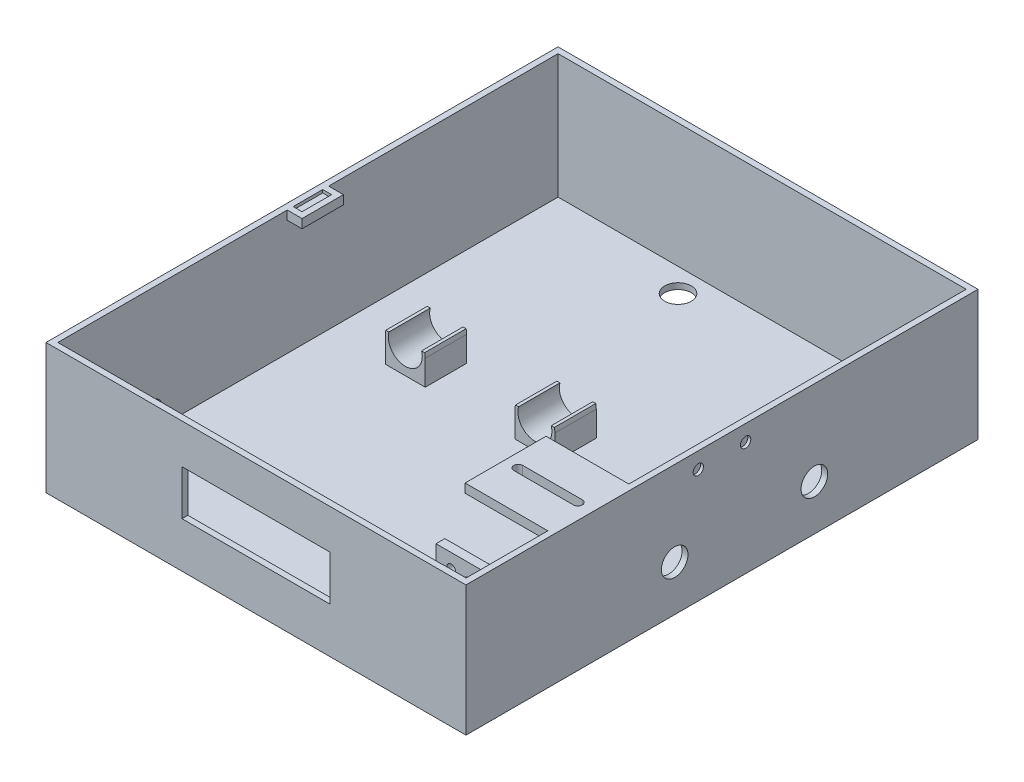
ISO-10303-21;
HEADER;
FILE_DESCRIPTION(('STEP AP214'),'2;1');
FILE_NAME('part.step','',(''),(''),'','','');
FILE_SCHEMA(('AUTOMOTIVE_DESIGN { 1 0 10303 214 1 1 1 1 }'));
ENDSEC;
DATA;
#1=APPLICATION_CONTEXT('core data for automotive mechanical design processes');
#2=APPLICATION_PROTOCOL_DEFINITION('international standard','automotive_design',2000,#1);
#3=PRODUCT_CONTEXT('',#1,'mechanical');
#4=PRODUCT('Part','Part','',(#3));
#5=PRODUCT_RELATED_PRODUCT_CATEGORY('part','',(#4));
#6=PRODUCT_DEFINITION_FORMATION('','',#4);
#7=PRODUCT_DEFINITION_CONTEXT('part definition',#1,'design');
#8=PRODUCT_DEFINITION('design','',#6,#7);
#9=PRODUCT_DEFINITION_SHAPE('','',#8);
#10=(LENGTH_UNIT() NAMED_UNIT(*) SI_UNIT(.MILLI.,.METRE.));
#11=(NAMED_UNIT(*) PLANE_ANGLE_UNIT() SI_UNIT($,.RADIAN.));
#12=(NAMED_UNIT(*) SI_UNIT($,.STERADIAN.) SOLID_ANGLE_UNIT());
#13=UNCERTAINTY_MEASURE_WITH_UNIT(LENGTH_MEASURE(1.E-05),#10,'distance_accuracy_value','');
#14=(GEOMETRIC_REPRESENTATION_CONTEXT(3) GLOBAL_UNCERTAINTY_ASSIGNED_CONTEXT((#13)) GLOBAL_UNIT_ASSIGNED_CONTEXT((#10,
#11,#12)) REPRESENTATION_CONTEXT('',''));
#15=CARTESIAN_POINT('',(0.,0.,0.));
#16=DIRECTION('',(0.,0.,1.));
#17=DIRECTION('',(1.,0.,0.));
#18=AXIS2_PLACEMENT_3D('',#15,#16,#17);
#19=CARTESIAN_POINT('',(140.,2.,-86.1500000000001));
#20=DIRECTION('',(1.,0.,0.));
#21=DIRECTION('',(0.,0.,-1.));
#22=AXIS2_PLACEMENT_3D('',#19,#20,#21);
#23=PLANE('',#22);
#24=CARTESIAN_POINT('',(140.,15.3914525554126,-32.8139947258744));
#25=DIRECTION('',(1.,0.,0.));
#26=DIRECTION('',(0.,0.,-1.));
#27=AXIS2_PLACEMENT_3D('',#24,#25,#26);
#28=CIRCLE('',#27,4.5);
#29=CARTESIAN_POINT('',(140.,15.3914525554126,-37.3139947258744));
#30=VERTEX_POINT('',#29);
#31=EDGE_CURVE('E1480',#30,#30,#28,.T.);
#32=ORIENTED_EDGE('',*,*,#31,.T.);
#33=EDGE_LOOP('',(#32));
#34=FACE_BOUND('',#33,.T.);
#35=CARTESIAN_POINT('',(140.,15.3914525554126,14.4173213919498));
#36=DIRECTION('',(1.,0.,0.));
#37=DIRECTION('',(0.,0.,-1.));
#38=AXIS2_PLACEMENT_3D('',#35,#36,#37);
#39=CIRCLE('',#38,4.5);
#40=CARTESIAN_POINT('',(140.,15.3914525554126,9.91732139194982));
#41=VERTEX_POINT('',#40);
#42=EDGE_CURVE('E548',#41,#41,#39,.T.);
#43=ORIENTED_EDGE('',*,*,#42,.T.);
#44=EDGE_LOOP('',(#43));
#45=FACE_BOUND('',#44,.T.);
#46=DIRECTION('',(0.,1.,0.));
#47=VECTOR('',#46,1.);
#48=CARTESIAN_POINT('',(140.,44.,55.297879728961));
#49=LINE('',#48,#47);
#50=CARTESIAN_POINT('',(140.,41.,55.297879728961));
#51=VERTEX_POINT('',#50);
#52=CARTESIAN_POINT('',(140.,44.,55.297879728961));
#53=VERTEX_POINT('',#52);
#54=EDGE_CURVE('E463',#51,#53,#49,.T.);
#55=ORIENTED_EDGE('',*,*,#54,.F.);
#56=DIRECTION('',(0.,0.,1.));
#57=VECTOR('',#56,1.);
#58=CARTESIAN_POINT('',(140.,41.,55.297879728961));
#59=LINE('',#58,#57);
#60=CARTESIAN_POINT('',(140.,41.,27.918748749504));
#61=VERTEX_POINT('',#60);
#62=EDGE_CURVE('E474',#61,#51,#59,.T.);
#63=ORIENTED_EDGE('',*,*,#62,.F.);
#64=DIRECTION('',(0.,-1.,0.));
#65=VECTOR('',#64,1.);
#66=CARTESIAN_POINT('',(140.,44.,27.918748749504));
#67=LINE('',#66,#65);
#68=CARTESIAN_POINT('',(140.,44.,27.918748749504));
#69=VERTEX_POINT('',#68);
#70=EDGE_CURVE('E483',#69,#61,#67,.T.);
#71=ORIENTED_EDGE('',*,*,#70,.F.);
#72=DIRECTION('',(0.,0.,-1.));
#73=VECTOR('',#72,1.);
#74=CARTESIAN_POINT('',(140.,44.,-86.1500000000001));
#75=LINE('',#74,#73);
#76=CARTESIAN_POINT('',(140.,44.,-86.1500000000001));
#77=VERTEX_POINT('',#76);
#78=EDGE_CURVE('E561',#69,#77,#75,.T.);
#79=ORIENTED_EDGE('',*,*,#78,.T.);
#80=DIRECTION('',(0.,1.,0.));
#81=VECTOR('',#80,1.);
#82=CARTESIAN_POINT('',(140.,2.,-86.1500000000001));
#83=LINE('',#82,#81);
#84=CARTESIAN_POINT('',(140.,2.,-86.1500000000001));
#85=VERTEX_POINT('',#84);
#86=EDGE_CURVE('E563',#85,#77,#83,.T.);
#87=ORIENTED_EDGE('',*,*,#86,.F.);
#88=DIRECTION('',(0.,0.,-1.));
#89=VECTOR('',#88,1.);
#90=CARTESIAN_POINT('',(140.,2.,-86.1500000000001));
#91=LINE('',#90,#89);
#92=CARTESIAN_POINT('',(140.,2.,59.9999999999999));
#93=VERTEX_POINT('',#92);
#94=EDGE_CURVE('E552',#93,#85,#91,.T.);
#95=ORIENTED_EDGE('',*,*,#94,.F.);
#96=DIRECTION('',(0.,-1.,0.));
#97=VECTOR('',#96,1.);
#98=CARTESIAN_POINT('',(140.,2.,60.));
#99=LINE('',#98,#97);
#100=CARTESIAN_POINT('',(140.,29.,60.));
#101=VERTEX_POINT('',#100);
#102=EDGE_CURVE('E518',#101,#93,#99,.T.);
#103=ORIENTED_EDGE('',*,*,#102,.F.);
#104=DIRECTION('',(0.,0.,1.));
#105=VECTOR('',#104,1.);
#106=CARTESIAN_POINT('',(140.,29.,60.));
#107=LINE('',#106,#105);
#108=CARTESIAN_POINT('',(140.,29.,63.));
#109=VERTEX_POINT('',#108);
#110=EDGE_CURVE('E530',#101,#109,#107,.T.);
#111=ORIENTED_EDGE('',*,*,#110,.T.);
#112=DIRECTION('',(0.,-1.,0.));
#113=VECTOR('',#112,1.);
#114=CARTESIAN_POINT('',(140.,2.,63.));
#115=LINE('',#114,#113);
#116=CARTESIAN_POINT('',(140.,2.,62.9999999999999));
#117=VERTEX_POINT('',#116);
#118=EDGE_CURVE('E515',#109,#117,#115,.T.);
#119=ORIENTED_EDGE('',*,*,#118,.T.);
#120=CARTESIAN_POINT('',(140.,2.,82.9368850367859));
#121=VERTEX_POINT('',#120);
#122=EDGE_CURVE('E554',#121,#117,#91,.T.);
#123=ORIENTED_EDGE('',*,*,#122,.F.);
#124=DIRECTION('',(0.,1.,0.));
#125=VECTOR('',#124,1.);
#126=CARTESIAN_POINT('',(140.,2.,82.9368850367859));
#127=LINE('',#126,#125);
#128=CARTESIAN_POINT('',(140.,44.,82.9368850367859));
#129=VERTEX_POINT('',#128);
#130=EDGE_CURVE('E567',#121,#129,#127,.T.);
#131=ORIENTED_EDGE('',*,*,#130,.T.);
#132=EDGE_CURVE('E553',#129,#53,#75,.T.);
#133=ORIENTED_EDGE('',*,*,#132,.T.);
#134=EDGE_LOOP('',(#55,#63,#71,#79,#87,#95,#103,#111,#119,#123,#131,#133));
#135=FACE_BOUND('',#134,.T.);
#136=ADVANCED_FACE('F43',(#34,#45,#135),#23,.F.);
#137=CARTESIAN_POINT('',(0.,2.,0.));
#138=DIRECTION('',(0.,-1.,0.));
#139=DIRECTION('',(0.,0.,-1.));
#140=AXIS2_PLACEMENT_3D('',#137,#138,#139);
#141=PLANE('',#140);
#142=DIRECTION('',(-1.,0.,0.));
#143=VECTOR('',#142,1.);
#144=CARTESIAN_POINT('',(140.,2.,60.));
#145=LINE('',#144,#143);
#146=CARTESIAN_POINT('',(109.863473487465,2.,60.));
#147=VERTEX_POINT('',#146);
#148=EDGE_CURVE('E521',#93,#147,#145,.T.);
#149=ORIENTED_EDGE('',*,*,#148,.F.);
#150=ORIENTED_EDGE('',*,*,#94,.T.);
#151=DIRECTION('',(1.,0.,0.));
#152=VECTOR('',#151,1.);
#153=CARTESIAN_POINT('',(1.99999999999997,2.,-86.1500000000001));
#154=LINE('',#153,#152);
#155=CARTESIAN_POINT('',(1.99999999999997,2.,-86.1500000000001));
#156=VERTEX_POINT('',#155);
#157=EDGE_CURVE('E607',#156,#85,#154,.T.);
#158=ORIENTED_EDGE('',*,*,#157,.F.);
#159=DIRECTION('',(0.,0.,1.));
#160=VECTOR('',#159,1.);
#161=CARTESIAN_POINT('',(1.99999999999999,2.,20.));
#162=LINE('',#161,#160);
#163=CARTESIAN_POINT('',(1.99999999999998,2.,83.));
#164=VERTEX_POINT('',#163);
#165=EDGE_CURVE('E746',#156,#164,#162,.T.);
#166=ORIENTED_EDGE('',*,*,#165,.T.);
#167=DIRECTION('',(1.,0.,0.));
#168=VECTOR('',#167,1.);
#169=CARTESIAN_POINT('',(1.99999999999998,2.,83.));
#170=LINE('',#169,#168);
#171=CARTESIAN_POINT('',(132.,2.,83.));
#172=VERTEX_POINT('',#171);
#173=EDGE_CURVE('E579',#164,#172,#170,.T.);
#174=ORIENTED_EDGE('',*,*,#173,.T.);
#175=DIRECTION('',(0.,0.,1.));
#176=VECTOR('',#175,1.);
#177=CARTESIAN_POINT('',(132.,2.,-98.));
#178=LINE('',#177,#176);
#179=CARTESIAN_POINT('',(132.,2.,82.9368850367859));
#180=VERTEX_POINT('',#179);
#181=EDGE_CURVE('E744',#180,#172,#178,.T.);
#182=ORIENTED_EDGE('',*,*,#181,.F.);
#183=DIRECTION('',(1.,0.,0.));
#184=VECTOR('',#183,1.);
#185=CARTESIAN_POINT('',(132.,2.,82.9368850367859));
#186=LINE('',#185,#184);
#187=EDGE_CURVE('E549',#180,#121,#186,.T.);
#188=ORIENTED_EDGE('',*,*,#187,.T.);
#189=ORIENTED_EDGE('',*,*,#122,.T.);
#190=DIRECTION('',(-1.,0.,0.));
#191=VECTOR('',#190,1.);
#192=CARTESIAN_POINT('',(140.,2.,63.));
#193=LINE('',#192,#191);
#194=CARTESIAN_POINT('',(109.863473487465,2.,63.));
#195=VERTEX_POINT('',#194);
#196=EDGE_CURVE('E532',#117,#195,#193,.T.);
#197=ORIENTED_EDGE('',*,*,#196,.T.);
#198=DIRECTION('',(0.,0.,1.));
#199=VECTOR('',#198,1.);
#200=CARTESIAN_POINT('',(109.863473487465,2.,60.));
#201=LINE('',#200,#199);
#202=EDGE_CURVE('E542',#147,#195,#201,.T.);
#203=ORIENTED_EDGE('',*,*,#202,.F.);
#204=EDGE_LOOP('',(#149,#150,#158,#166,#174,#182,#188,#189,#197,#203));
#205=FACE_BOUND('',#204,.T.);
#206=DIRECTION('',(-1.,0.,0.));
#207=VECTOR('',#206,1.);
#208=CARTESIAN_POINT('',(0.,1.99999999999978,-7.99999999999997));
#209=LINE('',#208,#207);
#210=CARTESIAN_POINT('',(79.0667839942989,1.99999999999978,-7.99999999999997));
#211=VERTEX_POINT('',#210);
#212=CARTESIAN_POINT('',(65.5667839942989,1.99999999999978,-7.99999999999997));
#213=VERTEX_POINT('',#212);
#214=EDGE_CURVE('E704',#211,#213,#209,.T.);
#215=ORIENTED_EDGE('',*,*,#214,.T.);
#216=DIRECTION('',(0.,0.,-1.));
#217=VECTOR('',#216,1.);
#218=CARTESIAN_POINT('',(65.5667839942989,1.99999999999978,-7.99999999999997));
#219=LINE('',#218,#217);
#220=CARTESIAN_POINT('',(65.5667839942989,1.99999999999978,-22.));
#221=VERTEX_POINT('',#220);
#222=EDGE_CURVE('E720',#213,#221,#219,.T.);
#223=ORIENTED_EDGE('',*,*,#222,.T.);
#224=DIRECTION('',(-1.,0.,0.));
#225=VECTOR('',#224,1.);
#226=CARTESIAN_POINT('',(0.,1.99999999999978,-22.));
#227=LINE('',#226,#225);
#228=CARTESIAN_POINT('',(79.0667839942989,2.,-22.));
#229=VERTEX_POINT('',#228);
#230=EDGE_CURVE('E696',#229,#221,#227,.T.);
#231=ORIENTED_EDGE('',*,*,#230,.F.);
#232=DIRECTION('',(0.,0.,-1.));
#233=VECTOR('',#232,1.);
#234=CARTESIAN_POINT('',(79.0667839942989,1.99999999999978,-7.99999999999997));
#235=LINE('',#234,#233);
#236=EDGE_CURVE('E724',#211,#229,#235,.T.);
#237=ORIENTED_EDGE('',*,*,#236,.F.);
#238=EDGE_LOOP('',(#215,#223,#231,#237));
#239=FACE_BOUND('',#238,.T.);
#240=CARTESIAN_POINT('',(50.5332355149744,2.,-78.1745501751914));
#241=DIRECTION('',(0.,-1.,0.));
#242=DIRECTION('',(0.,0.,-1.));
#243=AXIS2_PLACEMENT_3D('',#240,#241,#242);
#244=CIRCLE('',#243,4.49558091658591);
#245=CARTESIAN_POINT('',(50.5332355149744,2.,-82.6701310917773));
#246=VERTEX_POINT('',#245);
#247=EDGE_CURVE('E733',#246,#246,#244,.T.);
#248=ORIENTED_EDGE('',*,*,#247,.T.);
#249=EDGE_LOOP('',(#248));
#250=FACE_BOUND('',#249,.T.);
#251=DIRECTION('',(1.,0.,0.));
#252=VECTOR('',#251,1.);
#253=CARTESIAN_POINT('',(100.8,1.99999999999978,-7.99999999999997));
#254=LINE('',#253,#252);
#255=CARTESIAN_POINT('',(21.733216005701,1.99999999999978,-7.99999999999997));
#256=VERTEX_POINT('',#255);
#257=CARTESIAN_POINT('',(35.2332160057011,1.99999999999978,-7.99999999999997));
#258=VERTEX_POINT('',#257);
#259=EDGE_CURVE('E645',#256,#258,#254,.T.);
#260=ORIENTED_EDGE('',*,*,#259,.F.);
#261=DIRECTION('',(0.,0.,-1.));
#262=VECTOR('',#261,1.);
#263=CARTESIAN_POINT('',(21.733216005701,1.99999999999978,-7.99999999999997));
#264=LINE('',#263,#262);
#265=CARTESIAN_POINT('',(21.733216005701,1.99999999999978,-22.));
#266=VERTEX_POINT('',#265);
#267=EDGE_CURVE('E673',#256,#266,#264,.T.);
#268=ORIENTED_EDGE('',*,*,#267,.T.);
#269=DIRECTION('',(1.,0.,0.));
#270=VECTOR('',#269,1.);
#271=CARTESIAN_POINT('',(100.8,1.99999999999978,-22.));
#272=LINE('',#271,#270);
#273=CARTESIAN_POINT('',(35.2332160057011,2.,-22.));
#274=VERTEX_POINT('',#273);
#275=EDGE_CURVE('E658',#266,#274,#272,.T.);
#276=ORIENTED_EDGE('',*,*,#275,.T.);
#277=DIRECTION('',(0.,0.,-1.));
#278=VECTOR('',#277,1.);
#279=CARTESIAN_POINT('',(35.2332160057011,1.99999999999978,-7.99999999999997));
#280=LINE('',#279,#278);
#281=EDGE_CURVE('E653',#258,#274,#280,.T.);
#282=ORIENTED_EDGE('',*,*,#281,.F.);
#283=EDGE_LOOP('',(#260,#268,#276,#282));
#284=FACE_BOUND('',#283,.T.);
#285=ADVANCED_FACE('F813',(#205,#239,#250,#284),#141,.F.);
#286=CARTESIAN_POINT('',(0.,44.,0.));
#287=DIRECTION('',(0.,1.,0.));
#288=DIRECTION('',(0.,0.,1.));
#289=AXIS2_PLACEMENT_3D('',#286,#287,#288);
#290=PLANE('',#289);
#291=DIRECTION('',(0.,0.,1.));
#292=VECTOR('',#291,1.);
#293=CARTESIAN_POINT('',(1.99999999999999,44.,-6.57500000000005));
#294=LINE('',#293,#292);
#295=CARTESIAN_POINT('',(1.99999999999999,44.,-6.57500000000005));
#296=VERTEX_POINT('',#295);
#297=CARTESIAN_POINT('',(1.99999999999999,44.,3.42499999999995));
#298=VERTEX_POINT('',#297);
#299=EDGE_CURVE('E58',#296,#298,#294,.T.);
#300=ORIENTED_EDGE('',*,*,#299,.F.);
#301=DIRECTION('',(-1.,0.,0.));
#302=VECTOR('',#301,1.);
#303=CARTESIAN_POINT('',(1.99999999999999,44.,-6.57500000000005));
#304=LINE('',#303,#302);
#305=CARTESIAN_POINT('',(4.99999999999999,44.,-6.57500000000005));
#306=VERTEX_POINT('',#305);
#307=EDGE_CURVE('E379',#306,#296,#304,.T.);
#308=ORIENTED_EDGE('',*,*,#307,.F.);
#309=DIRECTION('',(0.,0.,-1.));
#310=VECTOR('',#309,1.);
#311=CARTESIAN_POINT('',(4.99999999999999,44.,-6.57500000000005));
#312=LINE('',#311,#310);
#313=CARTESIAN_POINT('',(4.99999999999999,44.,3.42499999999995));
#314=VERTEX_POINT('',#313);
#315=EDGE_CURVE('E382',#314,#306,#312,.T.);
#316=ORIENTED_EDGE('',*,*,#315,.F.);
#317=DIRECTION('',(1.,0.,0.));
#318=VECTOR('',#317,1.);
#319=CARTESIAN_POINT('',(1.99999999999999,44.,3.42499999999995));
#320=LINE('',#319,#318);
#321=EDGE_CURVE('E391',#298,#314,#320,.T.);
#322=ORIENTED_EDGE('',*,*,#321,.F.);
#323=EDGE_LOOP('',(#300,#308,#316,#322));
#324=FACE_BOUND('',#323,.T.);
#325=DIRECTION('',(0.,0.,1.));
#326=VECTOR('',#325,1.);
#327=CARTESIAN_POINT('',(0.,44.,-100.));
#328=LINE('',#327,#326);
#329=CARTESIAN_POINT('',(0.,44.,-88.1451948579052));
#330=VERTEX_POINT('',#329);
#331=CARTESIAN_POINT('',(0.,44.,85.));
#332=VERTEX_POINT('',#331);
#333=EDGE_CURVE('E742',#330,#332,#328,.T.);
#334=ORIENTED_EDGE('',*,*,#333,.T.);
#335=DIRECTION('',(1.,0.,0.));
#336=VECTOR('',#335,1.);
#337=CARTESIAN_POINT('',(0.,44.,85.));
#338=LINE('',#337,#336);
#339=CARTESIAN_POINT('',(142.,44.,85.));
#340=VERTEX_POINT('',#339);
#341=EDGE_CURVE('E597',#332,#340,#338,.T.);
#342=ORIENTED_EDGE('',*,*,#341,.T.);
#343=DIRECTION('',(0.,0.,-1.));
#344=VECTOR('',#343,1.);
#345=CARTESIAN_POINT('',(142.,44.,85.));
#346=LINE('',#345,#344);
#347=CARTESIAN_POINT('',(142.,44.,-88.1451948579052));
#348=VERTEX_POINT('',#347);
#349=EDGE_CURVE('E566',#340,#348,#346,.T.);
#350=ORIENTED_EDGE('',*,*,#349,.T.);
#351=DIRECTION('',(-1.,0.,0.));
#352=VECTOR('',#351,1.);
#353=CARTESIAN_POINT('',(0.,44.,-88.1451948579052));
#354=LINE('',#353,#352);
#355=EDGE_CURVE('E615',#348,#330,#354,.T.);
#356=ORIENTED_EDGE('',*,*,#355,.T.);
#357=EDGE_LOOP('',(#334,#342,#350,#356));
#358=FACE_BOUND('',#357,.T.);
#359=DIRECTION('',(-1.,0.,0.));
#360=VECTOR('',#359,1.);
#361=CARTESIAN_POINT('',(3.99999999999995,44.,-8.57500000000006));
#362=LINE('',#361,#360);
#363=CARTESIAN_POINT('',(6.99999999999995,44.,-8.57500000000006));
#364=VERTEX_POINT('',#363);
#365=CARTESIAN_POINT('',(1.99999999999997,44.,-8.57500000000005));
#366=VERTEX_POINT('',#365);
#367=EDGE_CURVE('E405',#364,#366,#362,.T.);
#368=ORIENTED_EDGE('',*,*,#367,.T.);
#369=DIRECTION('',(0.,0.,1.));
#370=VECTOR('',#369,1.);
#371=CARTESIAN_POINT('',(1.99999999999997,44.,-98.));
#372=LINE('',#371,#370);
#373=CARTESIAN_POINT('',(1.99999999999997,44.,-86.1500000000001));
#374=VERTEX_POINT('',#373);
#375=EDGE_CURVE('E737',#374,#366,#372,.T.);
#376=ORIENTED_EDGE('',*,*,#375,.F.);
#377=DIRECTION('',(1.,0.,0.));
#378=VECTOR('',#377,1.);
#379=CARTESIAN_POINT('',(1.99999999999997,44.,-86.1500000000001));
#380=LINE('',#379,#378);
#381=EDGE_CURVE('E606',#374,#77,#380,.T.);
#382=ORIENTED_EDGE('',*,*,#381,.T.);
#383=ORIENTED_EDGE('',*,*,#78,.F.);
#384=DIRECTION('',(1.,0.,0.));
#385=VECTOR('',#384,1.);
#386=CARTESIAN_POINT('',(112.,44.,27.918748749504));
#387=LINE('',#386,#385);
#388=CARTESIAN_POINT('',(112.,44.,27.918748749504));
#389=VERTEX_POINT('',#388);
#390=EDGE_CURVE('E493',#389,#69,#387,.T.);
#391=ORIENTED_EDGE('',*,*,#390,.F.);
#392=DIRECTION('',(0.,0.,-1.));
#393=VECTOR('',#392,1.);
#394=CARTESIAN_POINT('',(112.,44.,55.297879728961));
#395=LINE('',#394,#393);
#396=CARTESIAN_POINT('',(112.,44.,55.297879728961));
#397=VERTEX_POINT('',#396);
#398=EDGE_CURVE('E473',#397,#389,#395,.T.);
#399=ORIENTED_EDGE('',*,*,#398,.F.);
#400=DIRECTION('',(1.,0.,0.));
#401=VECTOR('',#400,1.);
#402=CARTESIAN_POINT('',(112.,44.,55.297879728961));
#403=LINE('',#402,#401);
#404=EDGE_CURVE('E496',#397,#53,#403,.T.);
#405=ORIENTED_EDGE('',*,*,#404,.T.);
#406=ORIENTED_EDGE('',*,*,#132,.F.);
#407=DIRECTION('',(1.,0.,0.));
#408=VECTOR('',#407,1.);
#409=CARTESIAN_POINT('',(132.,44.,82.9368850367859));
#410=LINE('',#409,#408);
#411=CARTESIAN_POINT('',(132.,44.,82.9368850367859));
#412=VERTEX_POINT('',#411);
#413=EDGE_CURVE('E558',#412,#129,#410,.T.);
#414=ORIENTED_EDGE('',*,*,#413,.F.);
#415=DIRECTION('',(0.,0.,-1.));
#416=VECTOR('',#415,1.);
#417=CARTESIAN_POINT('',(132.,44.,-98.));
#418=LINE('',#417,#416);
#419=CARTESIAN_POINT('',(132.,44.,83.));
#420=VERTEX_POINT('',#419);
#421=EDGE_CURVE('E739',#420,#412,#418,.T.);
#422=ORIENTED_EDGE('',*,*,#421,.F.);
#423=DIRECTION('',(1.,0.,0.));
#424=VECTOR('',#423,1.);
#425=CARTESIAN_POINT('',(1.99999999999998,44.,83.));
#426=LINE('',#425,#424);
#427=CARTESIAN_POINT('',(1.99999999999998,44.,83.));
#428=VERTEX_POINT('',#427);
#429=EDGE_CURVE('E582',#428,#420,#426,.T.);
#430=ORIENTED_EDGE('',*,*,#429,.F.);
#431=CARTESIAN_POINT('',(1.99999999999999,44.,5.42499999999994));
#432=VERTEX_POINT('',#431);
#433=EDGE_CURVE('E736',#432,#428,#372,.T.);
#434=ORIENTED_EDGE('',*,*,#433,.F.);
#435=DIRECTION('',(1.,0.,0.));
#436=VECTOR('',#435,1.);
#437=CARTESIAN_POINT('',(3.99999999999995,44.,5.42499999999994));
#438=LINE('',#437,#436);
#439=CARTESIAN_POINT('',(6.99999999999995,44.,5.42499999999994));
#440=VERTEX_POINT('',#439);
#441=EDGE_CURVE('E398',#432,#440,#438,.T.);
#442=ORIENTED_EDGE('',*,*,#441,.T.);
#443=DIRECTION('',(0.,0.,-1.));
#444=VECTOR('',#443,1.);
#445=CARTESIAN_POINT('',(6.99999999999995,44.,5.42499999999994));
#446=LINE('',#445,#444);
#447=EDGE_CURVE('E413',#440,#364,#446,.T.);
#448=ORIENTED_EDGE('',*,*,#447,.T.);
#449=EDGE_LOOP('',(#368,#376,#382,#383,#391,#399,#405,#406,#414,#422,#430,#434,#442,#448));
#450=FACE_BOUND('',#449,.T.);
#451=CARTESIAN_POINT('',(136.754489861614,44.,41.9003601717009));
#452=DIRECTION('',(0.,1.,0.));
#453=DIRECTION('',(0.,0.,1.));
#454=AXIS2_PLACEMENT_3D('',#451,#452,#453);
#455=CIRCLE('',#454,1.5);
#456=CARTESIAN_POINT('',(136.754489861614,44.,43.4003601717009));
#457=VERTEX_POINT('',#456);
#458=CARTESIAN_POINT('',(136.754489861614,44.,40.4003601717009));
#459=VERTEX_POINT('',#458);
#460=EDGE_CURVE('E443',#457,#459,#455,.T.);
#461=ORIENTED_EDGE('',*,*,#460,.F.);
#462=DIRECTION('',(1.,0.,0.));
#463=VECTOR('',#462,1.);
#464=CARTESIAN_POINT('',(136.754489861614,44.,43.4003601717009));
#465=LINE('',#464,#463);
#466=CARTESIAN_POINT('',(116.58860132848,44.,43.4003601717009));
#467=VERTEX_POINT('',#466);
#468=EDGE_CURVE('E457',#467,#457,#465,.T.);
#469=ORIENTED_EDGE('',*,*,#468,.F.);
#470=CARTESIAN_POINT('',(116.58860132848,44.,41.9003601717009));
#471=DIRECTION('',(0.,1.,0.));
#472=DIRECTION('',(0.,0.,1.));
#473=AXIS2_PLACEMENT_3D('',#470,#471,#472);
#474=CIRCLE('',#473,1.5);
#475=CARTESIAN_POINT('',(116.58860132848,44.,40.4003601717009));
#476=VERTEX_POINT('',#475);
#477=EDGE_CURVE('E454',#476,#467,#474,.T.);
#478=ORIENTED_EDGE('',*,*,#477,.F.);
#479=DIRECTION('',(-1.,0.,0.));
#480=VECTOR('',#479,1.);
#481=CARTESIAN_POINT('',(136.754489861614,44.,40.4003601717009));
#482=LINE('',#481,#480);
#483=EDGE_CURVE('E451',#459,#476,#482,.T.);
#484=ORIENTED_EDGE('',*,*,#483,.F.);
#485=EDGE_LOOP('',(#461,#469,#478,#484));
#486=FACE_BOUND('',#485,.T.);
#487=ADVANCED_FACE('F821',(#324,#358,#450,#486),#290,.T.);
#488=CARTESIAN_POINT('',(28.4832160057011,10.5,-7.99999999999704));
#489=DIRECTION('',(0.,0.,-1.));
#490=DIRECTION('',(-1.,0.,0.));
#491=AXIS2_PLACEMENT_3D('',#488,#489,#490);
#492=CYLINDRICAL_SURFACE('',#491,6.75);
#493=CARTESIAN_POINT('',(28.4832160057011,10.5,-7.99999999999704));
#494=DIRECTION('',(0.,0.,0.999999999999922));
#495=DIRECTION('',(1.,0.,0.));
#496=AXIS2_PLACEMENT_3D('',#493,#494,#495);
#497=CIRCLE('',#496,6.75);
#498=CARTESIAN_POINT('',(21.9160712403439,12.0604837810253,-7.99999999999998));
#499=VERTEX_POINT('',#498);
#500=CARTESIAN_POINT('',(21.733216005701,10.5,-7.99999999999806));
#501=VERTEX_POINT('',#500);
#502=EDGE_CURVE('E649',#499,#501,#497,.T.);
#503=ORIENTED_EDGE('',*,*,#502,.F.);
#504=DIRECTION('',(0.,0.,-1.));
#505=VECTOR('',#504,1.);
#506=CARTESIAN_POINT('',(21.916071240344,12.0604837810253,-7.99999999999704));
#507=LINE('',#506,#505);
#508=CARTESIAN_POINT('',(21.9160712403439,12.0604837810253,-22.));
#509=VERTEX_POINT('',#508);
#510=EDGE_CURVE('E634',#499,#509,#507,.T.);
#511=ORIENTED_EDGE('',*,*,#510,.T.);
#512=CARTESIAN_POINT('',(28.4832160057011,10.5,-21.9999999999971));
#513=DIRECTION('',(0.,0.,0.999999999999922));
#514=DIRECTION('',(1.,0.,0.));
#515=AXIS2_PLACEMENT_3D('',#512,#513,#514);
#516=CIRCLE('',#515,6.75);
#517=CARTESIAN_POINT('',(21.733216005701,10.5,-21.9999999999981));
#518=VERTEX_POINT('',#517);
#519=EDGE_CURVE('E664',#509,#518,#516,.T.);
#520=ORIENTED_EDGE('',*,*,#519,.T.);
#521=DIRECTION('',(0.,0.,-1.));
#522=VECTOR('',#521,1.);
#523=CARTESIAN_POINT('',(21.733216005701,10.5,-7.99999999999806));
#524=LINE('',#523,#522);
#525=EDGE_CURVE('E670',#501,#518,#524,.T.);
#526=ORIENTED_EDGE('',*,*,#525,.F.);
#527=EDGE_LOOP('',(#503,#511,#520,#526));
#528=FACE_BOUND('',#527,.T.);
#529=ADVANCED_FACE('F873',(#528),#492,.T.);
#530=CARTESIAN_POINT('',(72.3167839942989,10.5,-7.99999999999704));
#531=DIRECTION('',(0.,0.,-1.));
#532=DIRECTION('',(-1.,0.,0.));
#533=AXIS2_PLACEMENT_3D('',#530,#531,#532);
#534=CYLINDRICAL_SURFACE('',#533,6.75);
#535=DIRECTION('',(0.,0.,-1.));
#536=VECTOR('',#535,1.);
#537=CARTESIAN_POINT('',(65.7496392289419,12.0604837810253,-7.99999999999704));
#538=LINE('',#537,#536);
#539=CARTESIAN_POINT('',(65.7496392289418,12.0604837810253,-22.));
#540=VERTEX_POINT('',#539);
#541=CARTESIAN_POINT('',(65.7496392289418,12.0604837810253,-7.99999999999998));
#542=VERTEX_POINT('',#541);
#543=EDGE_CURVE('E683',#540,#542,#538,.F.);
#544=ORIENTED_EDGE('',*,*,#543,.F.);
#545=CARTESIAN_POINT('',(72.3167839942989,10.5,-21.9999999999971));
#546=DIRECTION('',(0.,0.,-0.999999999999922));
#547=DIRECTION('',(-1.,0.,0.));
#548=AXIS2_PLACEMENT_3D('',#545,#546,#547);
#549=CIRCLE('',#548,6.75);
#550=CARTESIAN_POINT('',(65.5667839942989,10.5,-21.9999999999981));
#551=VERTEX_POINT('',#550);
#552=EDGE_CURVE('E713',#551,#540,#549,.T.);
#553=ORIENTED_EDGE('',*,*,#552,.F.);
#554=DIRECTION('',(0.,0.,-1.));
#555=VECTOR('',#554,1.);
#556=CARTESIAN_POINT('',(65.5667839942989,10.5,-7.99999999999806));
#557=LINE('',#556,#555);
#558=CARTESIAN_POINT('',(65.5667839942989,10.5,-7.99999999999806));
#559=VERTEX_POINT('',#558);
#560=EDGE_CURVE('E707',#559,#551,#557,.T.);
#561=ORIENTED_EDGE('',*,*,#560,.F.);
#562=CARTESIAN_POINT('',(72.3167839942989,10.5,-7.99999999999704));
#563=DIRECTION('',(0.,0.,-0.999999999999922));
#564=DIRECTION('',(-1.,0.,0.));
#565=AXIS2_PLACEMENT_3D('',#562,#563,#564);
#566=CIRCLE('',#565,6.75);
#567=EDGE_CURVE('E699',#559,#542,#566,.T.);
#568=ORIENTED_EDGE('',*,*,#567,.T.);
#569=EDGE_LOOP('',(#544,#553,#561,#568));
#570=FACE_BOUND('',#569,.T.);
#571=ADVANCED_FACE('F906',(#570),#534,.T.);
#572=CARTESIAN_POINT('',(132.,32.,-98.));
#573=DIRECTION('',(1.,0.,0.));
#574=DIRECTION('',(0.,0.,-1.));
#575=AXIS2_PLACEMENT_3D('',#572,#573,#574);
#576=PLANE('',#575);
#577=ORIENTED_EDGE('',*,*,#421,.T.);
#578=DIRECTION('',(0.,1.,0.));
#579=VECTOR('',#578,1.);
#580=CARTESIAN_POINT('',(132.,2.,82.9368850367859));
#581=LINE('',#580,#579);
#582=EDGE_CURVE('E557',#180,#412,#581,.T.);
#583=ORIENTED_EDGE('',*,*,#582,.F.);
#584=ORIENTED_EDGE('',*,*,#181,.T.);
#585=DIRECTION('',(0.,-1.,0.));
#586=VECTOR('',#585,1.);
#587=CARTESIAN_POINT('',(132.,44.,83.));
#588=LINE('',#587,#586);
#589=EDGE_CURVE('E585',#420,#172,#588,.T.);
#590=ORIENTED_EDGE('',*,*,#589,.F.);
#591=EDGE_LOOP('',(#577,#583,#584,#590));
#592=FACE_BOUND('',#591,.T.);
#593=ADVANCED_FACE('F921',(#592),#576,.F.);
#594=CARTESIAN_POINT('',(1.99999999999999,0.,0.));
#595=DIRECTION('',(-1.,0.,0.));
#596=DIRECTION('',(0.,0.,1.));
#597=AXIS2_PLACEMENT_3D('',#594,#595,#596);
#598=PLANE('',#597);
#599=ORIENTED_EDGE('',*,*,#375,.T.);
#600=DIRECTION('',(0.,-1.,0.));
#601=VECTOR('',#600,1.);
#602=CARTESIAN_POINT('',(1.99999999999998,0.,-8.57500000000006));
#603=LINE('',#602,#601);
#604=CARTESIAN_POINT('',(1.99999999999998,41.,-8.57500000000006));
#605=VERTEX_POINT('',#604);
#606=EDGE_CURVE('E66',#366,#605,#603,.T.);
#607=ORIENTED_EDGE('',*,*,#606,.T.);
#608=DIRECTION('',(0.,0.,-1.));
#609=VECTOR('',#608,1.);
#610=CARTESIAN_POINT('',(1.99999999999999,41.,0.));
#611=LINE('',#610,#609);
#612=CARTESIAN_POINT('',(1.99999999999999,41.,5.42499999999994));
#613=VERTEX_POINT('',#612);
#614=EDGE_CURVE('E421',#613,#605,#611,.T.);
#615=ORIENTED_EDGE('',*,*,#614,.F.);
#616=DIRECTION('',(0.,1.,0.));
#617=VECTOR('',#616,1.);
#618=CARTESIAN_POINT('',(1.99999999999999,0.,5.42499999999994));
#619=LINE('',#618,#617);
#620=EDGE_CURVE('E425',#613,#432,#619,.T.);
#621=ORIENTED_EDGE('',*,*,#620,.T.);
#622=ORIENTED_EDGE('',*,*,#433,.T.);
#623=DIRECTION('',(0.,-1.,0.));
#624=VECTOR('',#623,1.);
#625=CARTESIAN_POINT('',(1.99999999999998,44.,83.));
#626=LINE('',#625,#624);
#627=EDGE_CURVE('E590',#428,#164,#626,.T.);
#628=ORIENTED_EDGE('',*,*,#627,.T.);
#629=ORIENTED_EDGE('',*,*,#165,.F.);
#630=DIRECTION('',(0.,1.,0.));
#631=VECTOR('',#630,1.);
#632=CARTESIAN_POINT('',(1.99999999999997,2.,-86.1500000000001));
#633=LINE('',#632,#631);
#634=EDGE_CURVE('E610',#156,#374,#633,.T.);
#635=ORIENTED_EDGE('',*,*,#634,.T.);
#636=EDGE_LOOP('',(#599,#607,#615,#621,#622,#628,#629,#635));
#637=FACE_BOUND('',#636,.T.);
#638=CARTESIAN_POINT('',(1.99999999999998,8.00000000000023,50.8312591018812));
#639=DIRECTION('',(-1.,0.,0.));
#640=DIRECTION('',(0.,0.,1.));
#641=AXIS2_PLACEMENT_3D('',#638,#639,#640);
#642=CIRCLE('',#641,3.);
#643=CARTESIAN_POINT('',(1.99999999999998,8.00000000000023,53.8312591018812));
#644=VERTEX_POINT('',#643);
#645=EDGE_CURVE('E594',#644,#644,#642,.T.);
#646=ORIENTED_EDGE('',*,*,#645,.T.);
#647=EDGE_LOOP('',(#646));
#648=FACE_BOUND('',#647,.T.);
#649=ADVANCED_FACE('F924',(#637,#648),#598,.F.);
#650=CARTESIAN_POINT('',(0.,2.,0.));
#651=DIRECTION('',(1.,0.,0.));
#652=DIRECTION('',(0.,0.,-1.));
#653=AXIS2_PLACEMENT_3D('',#650,#651,#652);
#654=PLANE('',#653);
#655=DIRECTION('',(0.,1.,0.));
#656=VECTOR('',#655,1.);
#657=CARTESIAN_POINT('',(0.,0.,85.));
#658=LINE('',#657,#656);
#659=CARTESIAN_POINT('',(0.,0.,85.));
#660=VERTEX_POINT('',#659);
#661=EDGE_CURVE('E602',#660,#332,#658,.T.);
#662=ORIENTED_EDGE('',*,*,#661,.T.);
#663=ORIENTED_EDGE('',*,*,#333,.F.);
#664=DIRECTION('',(0.,1.,0.));
#665=VECTOR('',#664,1.);
#666=CARTESIAN_POINT('',(0.,0.,-88.1451948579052));
#667=LINE('',#666,#665);
#668=CARTESIAN_POINT('',(0.,0.,-88.1451948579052));
#669=VERTEX_POINT('',#668);
#670=EDGE_CURVE('E621',#669,#330,#667,.T.);
#671=ORIENTED_EDGE('',*,*,#670,.F.);
#672=DIRECTION('',(0.,0.,1.));
#673=VECTOR('',#672,1.);
#674=CARTESIAN_POINT('',(0.,0.,0.));
#675=LINE('',#674,#673);
#676=EDGE_CURVE('E748',#669,#660,#675,.T.);
#677=ORIENTED_EDGE('',*,*,#676,.T.);
#678=EDGE_LOOP('',(#662,#663,#671,#677));
#679=FACE_BOUND('',#678,.T.);
#680=CARTESIAN_POINT('',(0.,8.00000000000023,50.8312591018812));
#681=DIRECTION('',(-1.,0.,0.));
#682=DIRECTION('',(0.,0.,1.));
#683=AXIS2_PLACEMENT_3D('',#680,#681,#682);
#684=CIRCLE('',#683,3.);
#685=CARTESIAN_POINT('',(0.,8.00000000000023,53.8312591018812));
#686=VERTEX_POINT('',#685);
#687=EDGE_CURVE('E593',#686,#686,#684,.T.);
#688=ORIENTED_EDGE('',*,*,#687,.F.);
#689=EDGE_LOOP('',(#688));
#690=FACE_BOUND('',#689,.T.);
#691=ADVANCED_FACE('F45',(#679,#690),#654,.F.);
#692=CARTESIAN_POINT('',(0.,0.,0.));
#693=DIRECTION('',(0.,-1.,0.));
#694=DIRECTION('',(0.,0.,-1.));
#695=AXIS2_PLACEMENT_3D('',#692,#693,#694);
#696=PLANE('',#695);
#697=DIRECTION('',(-1.,0.,0.));
#698=VECTOR('',#697,1.);
#699=CARTESIAN_POINT('',(0.,0.,-88.1451948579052));
#700=LINE('',#699,#698);
#701=CARTESIAN_POINT('',(142.,0.,-88.1451948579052));
#702=VERTEX_POINT('',#701);
#703=EDGE_CURVE('E618',#702,#669,#700,.T.);
#704=ORIENTED_EDGE('',*,*,#703,.F.);
#705=DIRECTION('',(0.,0.,-1.));
#706=VECTOR('',#705,1.);
#707=CARTESIAN_POINT('',(142.,0.,85.));
#708=LINE('',#707,#706);
#709=CARTESIAN_POINT('',(142.,0.,85.));
#710=VERTEX_POINT('',#709);
#711=EDGE_CURVE('E572',#710,#702,#708,.T.);
#712=ORIENTED_EDGE('',*,*,#711,.F.);
#713=DIRECTION('',(1.,0.,0.));
#714=VECTOR('',#713,1.);
#715=CARTESIAN_POINT('',(0.,0.,85.));
#716=LINE('',#715,#714);
#717=EDGE_CURVE('E600',#660,#710,#716,.T.);
#718=ORIENTED_EDGE('',*,*,#717,.F.);
#719=ORIENTED_EDGE('',*,*,#676,.F.);
#720=EDGE_LOOP('',(#704,#712,#718,#719));
#721=FACE_BOUND('',#720,.T.);
#722=CARTESIAN_POINT('',(50.5332355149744,0.,-78.1745501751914));
#723=DIRECTION('',(0.,-1.,0.));
#724=DIRECTION('',(0.,0.,-1.));
#725=AXIS2_PLACEMENT_3D('',#722,#723,#724);
#726=CIRCLE('',#725,4.49558091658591);
#727=CARTESIAN_POINT('',(50.5332355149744,0.,-82.6701310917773));
#728=VERTEX_POINT('',#727);
#729=EDGE_CURVE('E723',#728,#728,#726,.T.);
#730=ORIENTED_EDGE('',*,*,#729,.F.);
#731=EDGE_LOOP('',(#730));
#732=FACE_BOUND('',#731,.T.);
#733=ADVANCED_FACE('F916',(#721,#732),#696,.T.);
#734=CARTESIAN_POINT('',(50.5332355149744,34.,-78.1745501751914));
#735=DIRECTION('',(0.,-1.,0.));
#736=DIRECTION('',(0.,0.,-1.));
#737=AXIS2_PLACEMENT_3D('',#734,#735,#736);
#738=CYLINDRICAL_SURFACE('',#737,4.49558091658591);
#739=ORIENTED_EDGE('',*,*,#729,.T.);
#740=EDGE_LOOP('',(#739));
#741=FACE_BOUND('',#740,.T.);
#742=ORIENTED_EDGE('',*,*,#247,.F.);
#743=EDGE_LOOP('',(#742));
#744=FACE_BOUND('',#743,.T.);
#745=ADVANCED_FACE('F909',(#741,#744),#738,.F.);
#746=CARTESIAN_POINT('',(65.5667839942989,0.,-7.99999999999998));
#747=DIRECTION('',(1.,0.,0.));
#748=DIRECTION('',(0.,0.,-1.));
#749=AXIS2_PLACEMENT_3D('',#746,#747,#748);
#750=PLANE('',#749);
#751=DIRECTION('',(0.,-1.,0.));
#752=VECTOR('',#751,1.);
#753=CARTESIAN_POINT('',(65.5667839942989,0.,-22.));
#754=LINE('',#753,#752);
#755=EDGE_CURVE('E710',#551,#221,#754,.T.);
#756=ORIENTED_EDGE('',*,*,#755,.T.);
#757=ORIENTED_EDGE('',*,*,#222,.F.);
#758=DIRECTION('',(0.,-1.,0.));
#759=VECTOR('',#758,1.);
#760=CARTESIAN_POINT('',(65.5667839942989,0.,-7.99999999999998));
#761=LINE('',#760,#759);
#762=EDGE_CURVE('E695',#559,#213,#761,.T.);
#763=ORIENTED_EDGE('',*,*,#762,.F.);
#764=ORIENTED_EDGE('',*,*,#560,.T.);
#765=EDGE_LOOP('',(#756,#757,#763,#764));
#766=FACE_BOUND('',#765,.T.);
#767=ADVANCED_FACE('F901',(#766),#750,.F.);
#768=CARTESIAN_POINT('',(79.0667839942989,0.,-7.99999999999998));
#769=DIRECTION('',(1.,0.,0.));
#770=DIRECTION('',(0.,0.,-1.));
#771=AXIS2_PLACEMENT_3D('',#768,#769,#770);
#772=PLANE('',#771);
#773=DIRECTION('',(0.,-1.,0.));
#774=VECTOR('',#773,1.);
#775=CARTESIAN_POINT('',(79.0667839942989,0.,-22.));
#776=LINE('',#775,#774);
#777=CARTESIAN_POINT('',(79.0667839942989,10.5,-21.9999999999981));
#778=VERTEX_POINT('',#777);
#779=EDGE_CURVE('E716',#778,#229,#776,.T.);
#780=ORIENTED_EDGE('',*,*,#779,.F.);
#781=DIRECTION('',(0.,0.,-1.));
#782=VECTOR('',#781,1.);
#783=CARTESIAN_POINT('',(79.0667839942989,10.5,-7.99999999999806));
#784=LINE('',#783,#782);
#785=CARTESIAN_POINT('',(79.0667839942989,10.5,-7.99999999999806));
#786=VERTEX_POINT('',#785);
#787=EDGE_CURVE('E727',#786,#778,#784,.T.);
#788=ORIENTED_EDGE('',*,*,#787,.F.);
#789=DIRECTION('',(0.,-1.,0.));
#790=VECTOR('',#789,1.);
#791=CARTESIAN_POINT('',(79.0667839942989,0.,-7.99999999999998));
#792=LINE('',#791,#790);
#793=EDGE_CURVE('E702',#786,#211,#792,.T.);
#794=ORIENTED_EDGE('',*,*,#793,.T.);
#795=ORIENTED_EDGE('',*,*,#236,.T.);
#796=EDGE_LOOP('',(#780,#788,#794,#795));
#797=FACE_BOUND('',#796,.T.);
#798=ADVANCED_FACE('F897',(#797),#772,.T.);
#799=CARTESIAN_POINT('',(72.3167839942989,10.5,-7.99999999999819));
#800=DIRECTION('',(0.,0.,-1.));
#801=DIRECTION('',(-1.,0.,0.));
#802=AXIS2_PLACEMENT_3D('',#799,#800,#801);
#803=CYLINDRICAL_SURFACE('',#802,5.75000000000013);
#804=CARTESIAN_POINT('',(72.3167839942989,10.5,-21.9999999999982));
#805=DIRECTION('',(0.,0.,-0.999999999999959));
#806=DIRECTION('',(-1.,0.,0.));
#807=AXIS2_PLACEMENT_3D('',#804,#805,#806);
#808=CIRCLE('',#807,5.75000000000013);
#809=CARTESIAN_POINT('',(77.850985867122,12.0604837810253,-22.));
#810=VERTEX_POINT('',#809);
#811=CARTESIAN_POINT('',(66.7825821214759,12.0604837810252,-21.9999999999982));
#812=VERTEX_POINT('',#811);
#813=EDGE_CURVE('E691',#810,#812,#808,.T.);
#814=ORIENTED_EDGE('',*,*,#813,.T.);
#815=DIRECTION('',(0.,0.,-1.));
#816=VECTOR('',#815,1.);
#817=CARTESIAN_POINT('',(66.7825821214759,12.0604837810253,-7.99999999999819));
#818=LINE('',#817,#816);
#819=CARTESIAN_POINT('',(66.7825821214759,12.0604837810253,-7.99999999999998));
#820=VERTEX_POINT('',#819);
#821=EDGE_CURVE('E688',#812,#820,#818,.F.);
#822=ORIENTED_EDGE('',*,*,#821,.T.);
#823=CARTESIAN_POINT('',(72.3167839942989,10.5,-7.99999999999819));
#824=DIRECTION('',(0.,0.,-0.999999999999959));
#825=DIRECTION('',(-1.,0.,0.));
#826=AXIS2_PLACEMENT_3D('',#823,#824,#825);
#827=CIRCLE('',#826,5.75000000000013);
#828=CARTESIAN_POINT('',(77.850985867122,12.0604837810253,-7.99999999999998));
#829=VERTEX_POINT('',#828);
#830=EDGE_CURVE('E692',#829,#820,#827,.T.);
#831=ORIENTED_EDGE('',*,*,#830,.F.);
#832=DIRECTION('',(0.,0.,-1.));
#833=VECTOR('',#832,1.);
#834=CARTESIAN_POINT('',(77.850985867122,12.0604837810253,-7.99999999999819));
#835=LINE('',#834,#833);
#836=EDGE_CURVE('E685',#829,#810,#835,.T.);
#837=ORIENTED_EDGE('',*,*,#836,.T.);
#838=EDGE_LOOP('',(#814,#822,#831,#837));
#839=FACE_BOUND('',#838,.T.);
#840=ADVANCED_FACE('F900',(#839),#803,.F.);
#841=DIRECTION('',(0.,0.,-1.));
#842=VECTOR('',#841,1.);
#843=CARTESIAN_POINT('',(78.883928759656,12.0604837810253,-7.99999999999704));
#844=LINE('',#843,#842);
#845=CARTESIAN_POINT('',(78.8839287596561,12.0604837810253,-7.99999999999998));
#846=VERTEX_POINT('',#845);
#847=CARTESIAN_POINT('',(78.8839287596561,12.0604837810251,-21.9999999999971));
#848=VERTEX_POINT('',#847);
#849=EDGE_CURVE('E681',#846,#848,#844,.T.);
#850=ORIENTED_EDGE('',*,*,#849,.F.);
#851=EDGE_CURVE('E698',#846,#786,#566,.T.);
#852=ORIENTED_EDGE('',*,*,#851,.T.);
#853=ORIENTED_EDGE('',*,*,#787,.T.);
#854=EDGE_CURVE('E712',#848,#778,#549,.T.);
#855=ORIENTED_EDGE('',*,*,#854,.F.);
#856=EDGE_LOOP('',(#850,#852,#853,#855));
#857=FACE_BOUND('',#856,.T.);
#858=ADVANCED_FACE('F892',(#857),#534,.T.);
#859=CARTESIAN_POINT('',(0.,0.,-7.99999999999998));
#860=DIRECTION('',(0.,0.,-1.));
#861=DIRECTION('',(-1.,0.,0.));
#862=AXIS2_PLACEMENT_3D('',#859,#860,#861);
#863=PLANE('',#862);
#864=ORIENTED_EDGE('',*,*,#851,.F.);
#865=DIRECTION('',(-1.,0.,0.));
#866=VECTOR('',#865,1.);
#867=CARTESIAN_POINT('',(82.5787121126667,12.0604837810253,-7.99999999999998));
#868=LINE('',#867,#866);
#869=EDGE_CURVE('E680',#846,#829,#868,.T.);
#870=ORIENTED_EDGE('',*,*,#869,.T.);
#871=ORIENTED_EDGE('',*,*,#830,.T.);
#872=EDGE_CURVE('E669',#820,#542,#868,.T.);
#873=ORIENTED_EDGE('',*,*,#872,.T.);
#874=ORIENTED_EDGE('',*,*,#567,.F.);
#875=ORIENTED_EDGE('',*,*,#762,.T.);
#876=ORIENTED_EDGE('',*,*,#214,.F.);
#877=ORIENTED_EDGE('',*,*,#793,.F.);
#878=EDGE_LOOP('',(#864,#870,#871,#873,#874,#875,#876,#877));
#879=FACE_BOUND('',#878,.T.);
#880=ADVANCED_FACE('F889',(#879),#863,.F.);
#881=CARTESIAN_POINT('',(0.,0.,-22.));
#882=DIRECTION('',(0.,0.,-1.));
#883=DIRECTION('',(-1.,0.,0.));
#884=AXIS2_PLACEMENT_3D('',#881,#882,#883);
#885=PLANE('',#884);
#886=DIRECTION('',(-1.,0.,0.));
#887=VECTOR('',#886,1.);
#888=CARTESIAN_POINT('',(0.,12.0604837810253,-22.));
#889=LINE('',#888,#887);
#890=EDGE_CURVE('E752',#848,#810,#889,.T.);
#891=ORIENTED_EDGE('',*,*,#890,.F.);
#892=ORIENTED_EDGE('',*,*,#854,.T.);
#893=ORIENTED_EDGE('',*,*,#779,.T.);
#894=ORIENTED_EDGE('',*,*,#230,.T.);
#895=ORIENTED_EDGE('',*,*,#755,.F.);
#896=ORIENTED_EDGE('',*,*,#552,.T.);
#897=EDGE_CURVE('E750',#812,#540,#889,.T.);
#898=ORIENTED_EDGE('',*,*,#897,.F.);
#899=ORIENTED_EDGE('',*,*,#813,.F.);
#900=EDGE_LOOP('',(#891,#892,#893,#894,#895,#896,#898,#899));
#901=FACE_BOUND('',#900,.T.);
#902=ADVANCED_FACE('F887',(#901),#885,.T.);
#903=CARTESIAN_POINT('',(82.5787121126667,12.0604837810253,-7.99999999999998));
#904=DIRECTION('',(0.,-1.,0.));
#905=DIRECTION('',(0.,0.,-1.));
#906=AXIS2_PLACEMENT_3D('',#903,#904,#905);
#907=PLANE('',#906);
#908=ORIENTED_EDGE('',*,*,#897,.T.);
#909=ORIENTED_EDGE('',*,*,#543,.T.);
#910=ORIENTED_EDGE('',*,*,#872,.F.);
#911=ORIENTED_EDGE('',*,*,#821,.F.);
#912=EDGE_LOOP('',(#908,#909,#910,#911));
#913=FACE_BOUND('',#912,.T.);
#914=ADVANCED_FACE('F884',(#913),#907,.F.);
#915=ORIENTED_EDGE('',*,*,#869,.F.);
#916=ORIENTED_EDGE('',*,*,#849,.T.);
#917=ORIENTED_EDGE('',*,*,#890,.T.);
#918=ORIENTED_EDGE('',*,*,#836,.F.);
#919=EDGE_LOOP('',(#915,#916,#917,#918));
#920=FACE_BOUND('',#919,.T.);
#921=ADVANCED_FACE('F879',(#920),#907,.F.);
#922=CARTESIAN_POINT('',(35.2332160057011,0.,-7.99999999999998));
#923=DIRECTION('',(1.,0.,0.));
#924=DIRECTION('',(0.,0.,-1.));
#925=AXIS2_PLACEMENT_3D('',#922,#923,#924);
#926=PLANE('',#925);
#927=DIRECTION('',(0.,-1.,0.));
#928=VECTOR('',#927,1.);
#929=CARTESIAN_POINT('',(35.2332160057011,0.,-22.));
#930=LINE('',#929,#928);
#931=CARTESIAN_POINT('',(35.2332160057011,10.5,-21.9999999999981));
#932=VERTEX_POINT('',#931);
#933=EDGE_CURVE('E656',#932,#274,#930,.T.);
#934=ORIENTED_EDGE('',*,*,#933,.F.);
#935=DIRECTION('',(0.,0.,-1.));
#936=VECTOR('',#935,1.);
#937=CARTESIAN_POINT('',(35.2332160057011,10.5,-7.99999999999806));
#938=LINE('',#937,#936);
#939=CARTESIAN_POINT('',(35.2332160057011,10.5,-7.99999999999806));
#940=VERTEX_POINT('',#939);
#941=EDGE_CURVE('E667',#940,#932,#938,.T.);
#942=ORIENTED_EDGE('',*,*,#941,.F.);
#943=DIRECTION('',(0.,-1.,0.));
#944=VECTOR('',#943,1.);
#945=CARTESIAN_POINT('',(35.2332160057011,0.,-7.99999999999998));
#946=LINE('',#945,#944);
#947=EDGE_CURVE('E641',#940,#258,#946,.T.);
#948=ORIENTED_EDGE('',*,*,#947,.T.);
#949=ORIENTED_EDGE('',*,*,#281,.T.);
#950=EDGE_LOOP('',(#934,#942,#948,#949));
#951=FACE_BOUND('',#950,.T.);
#952=ADVANCED_FACE('F871',(#951),#926,.T.);
#953=CARTESIAN_POINT('',(35.0503607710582,12.0604837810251,-21.9999999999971));
#954=VERTEX_POINT('',#953);
#955=EDGE_CURVE('E642',#932,#954,#516,.T.);
#956=ORIENTED_EDGE('',*,*,#955,.T.);
#957=DIRECTION('',(0.,0.,-1.));
#958=VECTOR('',#957,1.);
#959=CARTESIAN_POINT('',(35.0503607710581,12.0604837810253,-7.99999999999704));
#960=LINE('',#959,#958);
#961=CARTESIAN_POINT('',(35.0503607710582,12.0604837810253,-7.99999999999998));
#962=VERTEX_POINT('',#961);
#963=EDGE_CURVE('E631',#954,#962,#960,.F.);
#964=ORIENTED_EDGE('',*,*,#963,.T.);
#965=EDGE_CURVE('E650',#940,#962,#497,.T.);
#966=ORIENTED_EDGE('',*,*,#965,.F.);
#967=ORIENTED_EDGE('',*,*,#941,.T.);
#968=EDGE_LOOP('',(#956,#964,#966,#967));
#969=FACE_BOUND('',#968,.T.);
#970=ADVANCED_FACE('F867',(#969),#492,.T.);
#971=CARTESIAN_POINT('',(21.733216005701,0.,-7.99999999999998));
#972=DIRECTION('',(1.,0.,0.));
#973=DIRECTION('',(0.,0.,-1.));
#974=AXIS2_PLACEMENT_3D('',#971,#972,#973);
#975=PLANE('',#974);
#976=DIRECTION('',(0.,-1.,0.));
#977=VECTOR('',#976,1.);
#978=CARTESIAN_POINT('',(21.733216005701,0.,-22.));
#979=LINE('',#978,#977);
#980=EDGE_CURVE('E661',#518,#266,#979,.T.);
#981=ORIENTED_EDGE('',*,*,#980,.T.);
#982=ORIENTED_EDGE('',*,*,#267,.F.);
#983=DIRECTION('',(0.,-1.,0.));
#984=VECTOR('',#983,1.);
#985=CARTESIAN_POINT('',(21.733216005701,0.,-7.99999999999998));
#986=LINE('',#985,#984);
#987=EDGE_CURVE('E647',#501,#256,#986,.T.);
#988=ORIENTED_EDGE('',*,*,#987,.F.);
#989=ORIENTED_EDGE('',*,*,#525,.T.);
#990=EDGE_LOOP('',(#981,#982,#988,#989));
#991=FACE_BOUND('',#990,.T.);
#992=ADVANCED_FACE('F870',(#991),#975,.F.);
#993=CARTESIAN_POINT('',(28.4832160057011,10.5,-7.99999999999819));
#994=DIRECTION('',(0.,0.,-1.));
#995=DIRECTION('',(-1.,0.,0.));
#996=AXIS2_PLACEMENT_3D('',#993,#994,#995);
#997=CYLINDRICAL_SURFACE('',#996,5.75000000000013);
#998=DIRECTION('',(0.,0.,-1.));
#999=VECTOR('',#998,1.);
#1000=CARTESIAN_POINT('',(22.949014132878,12.0604837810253,-7.99999999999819));
#1001=LINE('',#1000,#999);
#1002=CARTESIAN_POINT('',(22.949014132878,12.0604837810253,-7.99999999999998));
#1003=VERTEX_POINT('',#1002);
#1004=CARTESIAN_POINT('',(22.949014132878,12.0604837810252,-21.9999999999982));
#1005=VERTEX_POINT('',#1004);
#1006=EDGE_CURVE('E629',#1003,#1005,#1001,.T.);
#1007=ORIENTED_EDGE('',*,*,#1006,.F.);
#1008=CARTESIAN_POINT('',(28.4832160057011,10.5,-7.99999999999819));
#1009=DIRECTION('',(0.,0.,0.999999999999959));
#1010=DIRECTION('',(1.,0.,0.));
#1011=AXIS2_PLACEMENT_3D('',#1008,#1009,#1010);
#1012=CIRCLE('',#1011,5.75000000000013);
#1013=CARTESIAN_POINT('',(34.0174178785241,12.0604837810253,-7.99999999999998));
#1014=VERTEX_POINT('',#1013);
#1015=EDGE_CURVE('E638',#1003,#1014,#1012,.T.);
#1016=ORIENTED_EDGE('',*,*,#1015,.T.);
#1017=DIRECTION('',(0.,0.,-1.));
#1018=VECTOR('',#1017,1.);
#1019=CARTESIAN_POINT('',(34.0174178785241,12.0604837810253,-7.99999999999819));
#1020=LINE('',#1019,#1018);
#1021=CARTESIAN_POINT('',(34.0174178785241,12.0604837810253,-22.));
#1022=VERTEX_POINT('',#1021);
#1023=EDGE_CURVE('E627',#1022,#1014,#1020,.F.);
#1024=ORIENTED_EDGE('',*,*,#1023,.F.);
#1025=CARTESIAN_POINT('',(28.4832160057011,10.5,-21.9999999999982));
#1026=DIRECTION('',(0.,0.,0.999999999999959));
#1027=DIRECTION('',(1.,0.,0.));
#1028=AXIS2_PLACEMENT_3D('',#1025,#1026,#1027);
#1029=CIRCLE('',#1028,5.75000000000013);
#1030=EDGE_CURVE('E637',#1005,#1022,#1029,.T.);
#1031=ORIENTED_EDGE('',*,*,#1030,.F.);
#1032=EDGE_LOOP('',(#1007,#1016,#1024,#1031));
#1033=FACE_BOUND('',#1032,.T.);
#1034=ADVANCED_FACE('F862',(#1033),#997,.F.);
#1035=CARTESIAN_POINT('',(100.8,0.,-7.99999999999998));
#1036=DIRECTION('',(0.,0.,-1.));
#1037=DIRECTION('',(1.,0.,0.));
#1038=AXIS2_PLACEMENT_3D('',#1035,#1036,#1037);
#1039=PLANE('',#1038);
#1040=ORIENTED_EDGE('',*,*,#965,.T.);
#1041=DIRECTION('',(1.,0.,0.));
#1042=VECTOR('',#1041,1.);
#1043=CARTESIAN_POINT('',(65.7496392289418,12.0604837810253,-7.99999999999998));
#1044=LINE('',#1043,#1042);
#1045=EDGE_CURVE('E624',#1014,#962,#1044,.T.);
#1046=ORIENTED_EDGE('',*,*,#1045,.F.);
#1047=ORIENTED_EDGE('',*,*,#1015,.F.);
#1048=EDGE_CURVE('E626',#499,#1003,#1044,.T.);
#1049=ORIENTED_EDGE('',*,*,#1048,.F.);
#1050=ORIENTED_EDGE('',*,*,#502,.T.);
#1051=ORIENTED_EDGE('',*,*,#987,.T.);
#1052=ORIENTED_EDGE('',*,*,#259,.T.);
#1053=ORIENTED_EDGE('',*,*,#947,.F.);
#1054=EDGE_LOOP('',(#1040,#1046,#1047,#1049,#1050,#1051,#1052,#1053));
#1055=FACE_BOUND('',#1054,.T.);
#1056=ADVANCED_FACE('F859',(#1055),#1039,.F.);
#1057=CARTESIAN_POINT('',(100.8,0.,-22.));
#1058=DIRECTION('',(0.,0.,-1.));
#1059=DIRECTION('',(1.,0.,0.));
#1060=AXIS2_PLACEMENT_3D('',#1057,#1058,#1059);
#1061=PLANE('',#1060);
#1062=DIRECTION('',(-1.,0.,0.));
#1063=VECTOR('',#1062,1.);
#1064=CARTESIAN_POINT('',(100.8,12.0604837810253,-22.));
#1065=LINE('',#1064,#1063);
#1066=EDGE_CURVE('E755',#954,#1022,#1065,.T.);
#1067=ORIENTED_EDGE('',*,*,#1066,.F.);
#1068=ORIENTED_EDGE('',*,*,#955,.F.);
#1069=ORIENTED_EDGE('',*,*,#933,.T.);
#1070=ORIENTED_EDGE('',*,*,#275,.F.);
#1071=ORIENTED_EDGE('',*,*,#980,.F.);
#1072=ORIENTED_EDGE('',*,*,#519,.F.);
#1073=EDGE_CURVE('E753',#1005,#509,#1065,.T.);
#1074=ORIENTED_EDGE('',*,*,#1073,.F.);
#1075=ORIENTED_EDGE('',*,*,#1030,.T.);
#1076=EDGE_LOOP('',(#1067,#1068,#1069,#1070,#1071,#1072,#1074,#1075));
#1077=FACE_BOUND('',#1076,.T.);
#1078=ADVANCED_FACE('F857',(#1077),#1061,.T.);
#1079=CARTESIAN_POINT('',(65.7496392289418,12.0604837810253,-22.));
#1080=DIRECTION('',(0.,-1.,0.));
#1081=DIRECTION('',(0.,0.,-1.));
#1082=AXIS2_PLACEMENT_3D('',#1079,#1080,#1081);
#1083=PLANE('',#1082);
#1084=ORIENTED_EDGE('',*,*,#1048,.T.);
#1085=ORIENTED_EDGE('',*,*,#1006,.T.);
#1086=ORIENTED_EDGE('',*,*,#1073,.T.);
#1087=ORIENTED_EDGE('',*,*,#510,.F.);
#1088=EDGE_LOOP('',(#1084,#1085,#1086,#1087));
#1089=FACE_BOUND('',#1088,.T.);
#1090=ADVANCED_FACE('F854',(#1089),#1083,.F.);
#1091=ORIENTED_EDGE('',*,*,#1066,.T.);
#1092=ORIENTED_EDGE('',*,*,#1023,.T.);
#1093=ORIENTED_EDGE('',*,*,#1045,.T.);
#1094=ORIENTED_EDGE('',*,*,#963,.F.);
#1095=EDGE_LOOP('',(#1091,#1092,#1093,#1094));
#1096=FACE_BOUND('',#1095,.T.);
#1097=ADVANCED_FACE('F852',(#1096),#1083,.F.);
#1098=CARTESIAN_POINT('',(0.,0.,-88.1451948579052));
#1099=DIRECTION('',(0.,0.,-1.));
#1100=DIRECTION('',(-1.,0.,0.));
#1101=AXIS2_PLACEMENT_3D('',#1098,#1099,#1100);
#1102=PLANE('',#1101);
#1103=ORIENTED_EDGE('',*,*,#670,.T.);
#1104=ORIENTED_EDGE('',*,*,#355,.F.);
#1105=DIRECTION('',(0.,1.,0.));
#1106=VECTOR('',#1105,1.);
#1107=CARTESIAN_POINT('',(142.,0.,-88.1451948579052));
#1108=LINE('',#1107,#1106);
#1109=EDGE_CURVE('E576',#702,#348,#1108,.T.);
#1110=ORIENTED_EDGE('',*,*,#1109,.F.);
#1111=ORIENTED_EDGE('',*,*,#703,.T.);
#1112=EDGE_LOOP('',(#1103,#1104,#1110,#1111));
#1113=FACE_BOUND('',#1112,.T.);
#1114=ADVANCED_FACE('F848',(#1113),#1102,.T.);
#1115=CARTESIAN_POINT('',(1.99999999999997,2.,-86.1500000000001));
#1116=DIRECTION('',(0.,0.,1.));
#1117=DIRECTION('',(1.,0.,0.));
#1118=AXIS2_PLACEMENT_3D('',#1115,#1116,#1117);
#1119=PLANE('',#1118);
#1120=ORIENTED_EDGE('',*,*,#381,.F.);
#1121=ORIENTED_EDGE('',*,*,#634,.F.);
#1122=ORIENTED_EDGE('',*,*,#157,.T.);
#1123=ORIENTED_EDGE('',*,*,#86,.T.);
#1124=EDGE_LOOP('',(#1120,#1121,#1122,#1123));
#1125=FACE_BOUND('',#1124,.T.);
#1126=ADVANCED_FACE('F845',(#1125),#1119,.T.);
#1127=CARTESIAN_POINT('',(0.,0.,85.));
#1128=DIRECTION('',(0.,0.,1.));
#1129=DIRECTION('',(1.,0.,0.));
#1130=AXIS2_PLACEMENT_3D('',#1127,#1128,#1129);
#1131=PLANE('',#1130);
#1132=DIRECTION('',(1.,0.,0.));
#1133=VECTOR('',#1132,1.);
#1134=CARTESIAN_POINT('',(0.,15.3796552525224,85.));
#1135=LINE('',#1134,#1133);
#1136=CARTESIAN_POINT('',(45.9617244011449,15.3796552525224,85.));
#1137=VERTEX_POINT('',#1136);
#1138=CARTESIAN_POINT('',(96.0382755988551,15.3796552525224,85.));
#1139=VERTEX_POINT('',#1138);
#1140=EDGE_CURVE('E429',#1137,#1139,#1135,.T.);
#1141=ORIENTED_EDGE('',*,*,#1140,.F.);
#1142=DIRECTION('',(0.,1.,0.));
#1143=VECTOR('',#1142,1.);
#1144=CARTESIAN_POINT('',(45.9617244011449,0.,85.));
#1145=LINE('',#1144,#1143);
#1146=CARTESIAN_POINT('',(45.9617244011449,30.6203447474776,85.));
#1147=VERTEX_POINT('',#1146);
#1148=EDGE_CURVE('E437',#1137,#1147,#1145,.T.);
#1149=ORIENTED_EDGE('',*,*,#1148,.T.);
#1150=DIRECTION('',(1.,0.,0.));
#1151=VECTOR('',#1150,1.);
#1152=CARTESIAN_POINT('',(0.,30.6203447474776,85.));
#1153=LINE('',#1152,#1151);
#1154=CARTESIAN_POINT('',(96.0382755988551,30.6203447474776,85.));
#1155=VERTEX_POINT('',#1154);
#1156=EDGE_CURVE('E434',#1147,#1155,#1153,.T.);
#1157=ORIENTED_EDGE('',*,*,#1156,.T.);
#1158=DIRECTION('',(0.,1.,0.));
#1159=VECTOR('',#1158,1.);
#1160=CARTESIAN_POINT('',(96.0382755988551,0.,85.));
#1161=LINE('',#1160,#1159);
#1162=EDGE_CURVE('E431',#1139,#1155,#1161,.T.);
#1163=ORIENTED_EDGE('',*,*,#1162,.F.);
#1164=EDGE_LOOP('',(#1141,#1149,#1157,#1163));
#1165=FACE_BOUND('',#1164,.T.);
#1166=ORIENTED_EDGE('',*,*,#341,.F.);
#1167=ORIENTED_EDGE('',*,*,#661,.F.);
#1168=ORIENTED_EDGE('',*,*,#717,.T.);
#1169=DIRECTION('',(0.,1.,0.));
#1170=VECTOR('',#1169,1.);
#1171=CARTESIAN_POINT('',(142.,0.,85.));
#1172=LINE('',#1171,#1170);
#1173=EDGE_CURVE('E575',#710,#340,#1172,.T.);
#1174=ORIENTED_EDGE('',*,*,#1173,.T.);
#1175=EDGE_LOOP('',(#1166,#1167,#1168,#1174));
#1176=FACE_BOUND('',#1175,.T.);
#1177=ADVANCED_FACE('F792',(#1165,#1176),#1131,.T.);
#1178=CARTESIAN_POINT('',(1.99999999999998,8.00000000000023,50.8312591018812));
#1179=DIRECTION('',(-1.,0.,0.));
#1180=DIRECTION('',(0.,0.,1.));
#1181=AXIS2_PLACEMENT_3D('',#1178,#1179,#1180);
#1182=CYLINDRICAL_SURFACE('',#1181,3.);
#1183=ORIENTED_EDGE('',*,*,#645,.F.);
#1184=EDGE_LOOP('',(#1183));
#1185=FACE_BOUND('',#1184,.T.);
#1186=ORIENTED_EDGE('',*,*,#687,.T.);
#1187=EDGE_LOOP('',(#1186));
#1188=FACE_BOUND('',#1187,.T.);
#1189=ADVANCED_FACE('F839',(#1185,#1188),#1182,.F.);
#1190=CARTESIAN_POINT('',(1.99999999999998,44.,83.));
#1191=DIRECTION('',(0.,0.,-1.));
#1192=DIRECTION('',(-1.,0.,0.));
#1193=AXIS2_PLACEMENT_3D('',#1190,#1191,#1192);
#1194=PLANE('',#1193);
#1195=DIRECTION('',(-1.,0.,0.));
#1196=VECTOR('',#1195,1.);
#1197=CARTESIAN_POINT('',(1.99999999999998,15.3796552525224,83.));
#1198=LINE('',#1197,#1196);
#1199=CARTESIAN_POINT('',(96.0382755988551,15.3796552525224,83.));
#1200=VERTEX_POINT('',#1199);
#1201=CARTESIAN_POINT('',(45.9617244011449,15.3796552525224,83.));
#1202=VERTEX_POINT('',#1201);
#1203=EDGE_CURVE('E11',#1200,#1202,#1198,.T.);
#1204=ORIENTED_EDGE('',*,*,#1203,.F.);
#1205=DIRECTION('',(0.,-1.,0.));
#1206=VECTOR('',#1205,1.);
#1207=CARTESIAN_POINT('',(96.0382755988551,44.,83.));
#1208=LINE('',#1207,#1206);
#1209=CARTESIAN_POINT('',(96.0382755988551,30.6203447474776,83.));
#1210=VERTEX_POINT('',#1209);
#1211=EDGE_CURVE('E770',#1210,#1200,#1208,.T.);
#1212=ORIENTED_EDGE('',*,*,#1211,.F.);
#1213=DIRECTION('',(-1.,0.,0.));
#1214=VECTOR('',#1213,1.);
#1215=CARTESIAN_POINT('',(1.99999999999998,30.6203447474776,83.));
#1216=LINE('',#1215,#1214);
#1217=CARTESIAN_POINT('',(45.9617244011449,30.6203447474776,83.));
#1218=VERTEX_POINT('',#1217);
#1219=EDGE_CURVE('E772',#1210,#1218,#1216,.T.);
#1220=ORIENTED_EDGE('',*,*,#1219,.T.);
#1221=DIRECTION('',(0.,-1.,0.));
#1222=VECTOR('',#1221,1.);
#1223=CARTESIAN_POINT('',(45.9617244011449,44.,83.));
#1224=LINE('',#1223,#1222);
#1225=EDGE_CURVE('E51',#1218,#1202,#1224,.T.);
#1226=ORIENTED_EDGE('',*,*,#1225,.T.);
#1227=EDGE_LOOP('',(#1204,#1212,#1220,#1226));
#1228=FACE_BOUND('',#1227,.T.);
#1229=ORIENTED_EDGE('',*,*,#173,.F.);
#1230=ORIENTED_EDGE('',*,*,#627,.F.);
#1231=ORIENTED_EDGE('',*,*,#429,.T.);
#1232=ORIENTED_EDGE('',*,*,#589,.T.);
#1233=EDGE_LOOP('',(#1229,#1230,#1231,#1232));
#1234=FACE_BOUND('',#1233,.T.);
#1235=ADVANCED_FACE('F777',(#1228,#1234),#1194,.T.);
#1236=CARTESIAN_POINT('',(142.,0.,85.));
#1237=DIRECTION('',(1.,0.,0.));
#1238=DIRECTION('',(0.,0.,-1.));
#1239=AXIS2_PLACEMENT_3D('',#1236,#1237,#1238);
#1240=PLANE('',#1239);
#1241=CARTESIAN_POINT('',(142.,15.3914525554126,-32.8139947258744));
#1242=DIRECTION('',(1.,0.,0.));
#1243=DIRECTION('',(0.,0.,-1.));
#1244=AXIS2_PLACEMENT_3D('',#1241,#1242,#1243);
#1245=CIRCLE('',#1244,4.5);
#1246=CARTESIAN_POINT('',(142.,15.3914525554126,-37.3139947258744));
#1247=VERTEX_POINT('',#1246);
#1248=EDGE_CURVE('E1478',#1247,#1247,#1245,.T.);
#1249=ORIENTED_EDGE('',*,*,#1248,.F.);
#1250=EDGE_LOOP('',(#1249));
#1251=FACE_BOUND('',#1250,.T.);
#1252=CARTESIAN_POINT('',(142.,38.5,6.42740257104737));
#1253=DIRECTION('',(1.,0.,0.));
#1254=DIRECTION('',(0.,0.,-1.));
#1255=AXIS2_PLACEMENT_3D('',#1252,#1253,#1254);
#1256=CIRCLE('',#1255,1.75);
#1257=CARTESIAN_POINT('',(142.,38.5,4.67740257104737));
#1258=VERTEX_POINT('',#1257);
#1259=EDGE_CURVE('E1488',#1258,#1258,#1256,.T.);
#1260=ORIENTED_EDGE('',*,*,#1259,.F.);
#1261=EDGE_LOOP('',(#1260));
#1262=FACE_BOUND('',#1261,.T.);
#1263=CARTESIAN_POINT('',(142.,38.5,-9.57259742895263));
#1264=DIRECTION('',(1.,0.,0.));
#1265=DIRECTION('',(0.,0.,-1.));
#1266=AXIS2_PLACEMENT_3D('',#1263,#1264,#1265);
#1267=CIRCLE('',#1266,1.75);
#1268=CARTESIAN_POINT('',(142.,38.5,-11.3225974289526));
#1269=VERTEX_POINT('',#1268);
#1270=EDGE_CURVE('E1483',#1269,#1269,#1267,.T.);
#1271=ORIENTED_EDGE('',*,*,#1270,.F.);
#1272=EDGE_LOOP('',(#1271));
#1273=FACE_BOUND('',#1272,.T.);
#1274=CARTESIAN_POINT('',(142.,15.3914525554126,14.4173213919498));
#1275=DIRECTION('',(1.,0.,0.));
#1276=DIRECTION('',(0.,0.,-1.));
#1277=AXIS2_PLACEMENT_3D('',#1274,#1275,#1276);
#1278=CIRCLE('',#1277,4.5);
#1279=CARTESIAN_POINT('',(142.,15.3914525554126,9.91732139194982));
#1280=VERTEX_POINT('',#1279);
#1281=EDGE_CURVE('E545',#1280,#1280,#1278,.T.);
#1282=ORIENTED_EDGE('',*,*,#1281,.F.);
#1283=EDGE_LOOP('',(#1282));
#1284=FACE_BOUND('',#1283,.T.);
#1285=ORIENTED_EDGE('',*,*,#1109,.T.);
#1286=ORIENTED_EDGE('',*,*,#349,.F.);
#1287=ORIENTED_EDGE('',*,*,#1173,.F.);
#1288=ORIENTED_EDGE('',*,*,#711,.T.);
#1289=EDGE_LOOP('',(#1285,#1286,#1287,#1288));
#1290=FACE_BOUND('',#1289,.T.);
#1291=ADVANCED_FACE('F833',(#1251,#1262,#1273,#1284,#1290),#1240,.T.);
#1292=CARTESIAN_POINT('',(132.,2.,82.9368850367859));
#1293=DIRECTION('',(0.,0.,1.));
#1294=DIRECTION('',(1.,0.,0.));
#1295=AXIS2_PLACEMENT_3D('',#1292,#1293,#1294);
#1296=PLANE('',#1295);
#1297=ORIENTED_EDGE('',*,*,#413,.T.);
#1298=ORIENTED_EDGE('',*,*,#130,.F.);
#1299=ORIENTED_EDGE('',*,*,#187,.F.);
#1300=ORIENTED_EDGE('',*,*,#582,.T.);
#1301=EDGE_LOOP('',(#1297,#1298,#1299,#1300));
#1302=FACE_BOUND('',#1301,.T.);
#1303=ADVANCED_FACE('F830',(#1302),#1296,.F.);
#1304=CARTESIAN_POINT('',(100.,15.3914525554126,14.4173213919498));
#1305=DIRECTION('',(1.,0.,0.));
#1306=DIRECTION('',(0.,0.,-1.));
#1307=AXIS2_PLACEMENT_3D('',#1304,#1305,#1306);
#1308=CYLINDRICAL_SURFACE('',#1307,4.5);
#1309=CARTESIAN_POINT('',(142.,15.3914525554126,9.91732139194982));
#1310=CARTESIAN_POINT('',(141.979166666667,15.3914525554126,9.91732139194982));
#1311=CARTESIAN_POINT('',(141.958333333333,15.3914525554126,9.91732139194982));
#1312=CARTESIAN_POINT('',(141.916666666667,15.3914525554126,9.91732139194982));
#1313=CARTESIAN_POINT('',(141.895833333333,15.3914525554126,9.91732139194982));
#1314=CARTESIAN_POINT('',(141.854166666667,15.3914525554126,9.91732139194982));
#1315=CARTESIAN_POINT('',(141.833333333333,15.3914525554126,9.91732139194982));
#1316=CARTESIAN_POINT('',(141.791666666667,15.3914525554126,9.91732139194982));
#1317=CARTESIAN_POINT('',(141.770833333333,15.3914525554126,9.91732139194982));
#1318=CARTESIAN_POINT('',(141.729166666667,15.3914525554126,9.91732139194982));
#1319=CARTESIAN_POINT('',(141.708333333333,15.3914525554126,9.91732139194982));
#1320=CARTESIAN_POINT('',(141.666666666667,15.3914525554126,9.91732139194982));
#1321=CARTESIAN_POINT('',(141.645833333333,15.3914525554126,9.91732139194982));
#1322=CARTESIAN_POINT('',(141.604166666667,15.3914525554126,9.91732139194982));
#1323=CARTESIAN_POINT('',(141.583333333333,15.3914525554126,9.91732139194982));
#1324=CARTESIAN_POINT('',(141.541666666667,15.3914525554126,9.91732139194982));
#1325=CARTESIAN_POINT('',(141.520833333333,15.3914525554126,9.91732139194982));
#1326=CARTESIAN_POINT('',(141.479166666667,15.3914525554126,9.91732139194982));
#1327=CARTESIAN_POINT('',(141.458333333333,15.3914525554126,9.91732139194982));
#1328=CARTESIAN_POINT('',(141.416666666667,15.3914525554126,9.91732139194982));
#1329=CARTESIAN_POINT('',(141.395833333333,15.3914525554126,9.91732139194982));
#1330=CARTESIAN_POINT('',(141.354166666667,15.3914525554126,9.91732139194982));
#1331=CARTESIAN_POINT('',(141.333333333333,15.3914525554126,9.91732139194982));
#1332=CARTESIAN_POINT('',(141.291666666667,15.3914525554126,9.91732139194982));
#1333=CARTESIAN_POINT('',(141.270833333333,15.3914525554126,9.91732139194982));
#1334=CARTESIAN_POINT('',(141.229166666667,15.3914525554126,9.91732139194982));
#1335=CARTESIAN_POINT('',(141.208333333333,15.3914525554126,9.91732139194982));
#1336=CARTESIAN_POINT('',(141.166666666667,15.3914525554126,9.91732139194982));
#1337=CARTESIAN_POINT('',(141.145833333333,15.3914525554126,9.91732139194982));
#1338=CARTESIAN_POINT('',(141.104166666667,15.3914525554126,9.91732139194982));
#1339=CARTESIAN_POINT('',(141.083333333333,15.3914525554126,9.91732139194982));
#1340=CARTESIAN_POINT('',(141.041666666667,15.3914525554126,9.91732139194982));
#1341=CARTESIAN_POINT('',(141.020833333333,15.3914525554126,9.91732139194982));
#1342=CARTESIAN_POINT('',(140.979166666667,15.3914525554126,9.91732139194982));
#1343=CARTESIAN_POINT('',(140.958333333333,15.3914525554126,9.91732139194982));
#1344=CARTESIAN_POINT('',(140.916666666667,15.3914525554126,9.91732139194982));
#1345=CARTESIAN_POINT('',(140.895833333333,15.3914525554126,9.91732139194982));
#1346=CARTESIAN_POINT('',(140.854166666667,15.3914525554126,9.91732139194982));
#1347=CARTESIAN_POINT('',(140.833333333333,15.3914525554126,9.91732139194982));
#1348=CARTESIAN_POINT('',(140.791666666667,15.3914525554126,9.91732139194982));
#1349=CARTESIAN_POINT('',(140.770833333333,15.3914525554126,9.91732139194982));
#1350=CARTESIAN_POINT('',(140.729166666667,15.3914525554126,9.91732139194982));
#1351=CARTESIAN_POINT('',(140.708333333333,15.3914525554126,9.91732139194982));
#1352=CARTESIAN_POINT('',(140.666666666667,15.3914525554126,9.91732139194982));
#1353=CARTESIAN_POINT('',(140.645833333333,15.3914525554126,9.91732139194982));
#1354=CARTESIAN_POINT('',(140.604166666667,15.3914525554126,9.91732139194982));
#1355=CARTESIAN_POINT('',(140.583333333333,15.3914525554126,9.91732139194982));
#1356=CARTESIAN_POINT('',(140.541666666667,15.3914525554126,9.91732139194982));
#1357=CARTESIAN_POINT('',(140.520833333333,15.3914525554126,9.91732139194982));
#1358=CARTESIAN_POINT('',(140.479166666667,15.3914525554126,9.91732139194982));
#1359=CARTESIAN_POINT('',(140.458333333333,15.3914525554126,9.91732139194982));
#1360=CARTESIAN_POINT('',(140.416666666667,15.3914525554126,9.91732139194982));
#1361=CARTESIAN_POINT('',(140.395833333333,15.3914525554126,9.91732139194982));
#1362=CARTESIAN_POINT('',(140.354166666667,15.3914525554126,9.91732139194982));
#1363=CARTESIAN_POINT('',(140.333333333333,15.3914525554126,9.91732139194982));
#1364=CARTESIAN_POINT('',(140.291666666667,15.3914525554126,9.91732139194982));
#1365=CARTESIAN_POINT('',(140.270833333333,15.3914525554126,9.91732139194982));
#1366=CARTESIAN_POINT('',(140.229166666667,15.3914525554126,9.91732139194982));
#1367=CARTESIAN_POINT('',(140.208333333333,15.3914525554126,9.91732139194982));
#1368=CARTESIAN_POINT('',(140.166666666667,15.3914525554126,9.91732139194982));
#1369=CARTESIAN_POINT('',(140.145833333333,15.3914525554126,9.91732139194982));
#1370=CARTESIAN_POINT('',(140.104166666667,15.3914525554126,9.91732139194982));
#1371=CARTESIAN_POINT('',(140.083333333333,15.3914525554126,9.91732139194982));
#1372=CARTESIAN_POINT('',(140.041666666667,15.3914525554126,9.91732139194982));
#1373=CARTESIAN_POINT('',(140.020833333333,15.3914525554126,9.91732139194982));
#1374=CARTESIAN_POINT('',(140.,15.3914525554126,9.91732139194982));
#1375=B_SPLINE_CURVE_WITH_KNOTS('',3,(#1309,#1310,#1311,#1312,#1313,#1314,#1315,#1316,#1317,
#1318,#1319,#1320,#1321,#1322,#1323,#1324,#1325,#1326,#1327,#1328,#1329,#1330,#1331,#1332,#1333,
#1334,#1335,#1336,#1337,#1338,#1339,#1340,#1341,#1342,#1343,#1344,#1345,#1346,#1347,#1348,#1349,
#1350,#1351,#1352,#1353,#1354,#1355,#1356,#1357,#1358,#1359,#1360,#1361,#1362,#1363,#1364,#1365,
#1366,#1367,#1368,#1369,#1370,#1371,#1372,#1373,#1374),.UNSPECIFIED.,.F.,.F.,(4,2,2,2,2,2,2,2,2,
2,2,2,2,2,2,2,2,2,2,2,2,2,2,2,2,2,2,2,2,2,2,2,4),(0.,0.0624999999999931,0.124999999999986,
0.187500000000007,0.25,0.312499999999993,0.375000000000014,0.437500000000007,0.5,
0.562499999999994,0.625000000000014,0.687500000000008,0.750000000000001,0.812500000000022,
0.875000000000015,0.937500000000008,1.00000000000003,1.06250000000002,1.12500000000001,
1.18750000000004,1.25000000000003,1.31250000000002,1.37500000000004,1.43750000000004,
1.50000000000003,1.56250000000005,1.62500000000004,1.68750000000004,1.75000000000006,
1.81250000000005,1.87500000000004,1.93750000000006,2.00000000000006),.UNSPECIFIED.);
#1376=EDGE_CURVE('BSEAM828',#1280,#41,#1375,.T.);
#1377=ORIENTED_EDGE('',*,*,#1281,.T.);
#1378=ORIENTED_EDGE('',*,*,#42,.F.);
#1379=ORIENTED_EDGE('',*,*,#1376,.T.);
#1380=ORIENTED_EDGE('',*,*,#1376,.F.);
#1381=EDGE_LOOP('',(#1377,#1379,#1378,#1380));
#1382=FACE_BOUND('',#1381,.T.);
#1383=ADVANCED_FACE('F828',(#1382),#1308,.F.);
#1384=CARTESIAN_POINT('',(0.,0.,60.));
#1385=DIRECTION('',(0.,0.,1.));
#1386=DIRECTION('',(1.,0.,0.));
#1387=AXIS2_PLACEMENT_3D('',#1384,#1385,#1386);
#1388=PLANE('',#1387);
#1389=ORIENTED_EDGE('',*,*,#102,.T.);
#1390=ORIENTED_EDGE('',*,*,#148,.T.);
#1391=DIRECTION('',(0.,1.,0.));
#1392=VECTOR('',#1391,1.);
#1393=CARTESIAN_POINT('',(109.863473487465,2.,60.));
#1394=LINE('',#1393,#1392);
#1395=CARTESIAN_POINT('',(109.863473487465,29.,60.));
#1396=VERTEX_POINT('',#1395);
#1397=EDGE_CURVE('E525',#147,#1396,#1394,.T.);
#1398=ORIENTED_EDGE('',*,*,#1397,.T.);
#1399=DIRECTION('',(1.,0.,0.));
#1400=VECTOR('',#1399,1.);
#1401=CARTESIAN_POINT('',(140.,29.,60.));
#1402=LINE('',#1401,#1400);
#1403=EDGE_CURVE('E527',#1396,#101,#1402,.T.);
#1404=ORIENTED_EDGE('',*,*,#1403,.T.);
#1405=EDGE_LOOP('',(#1389,#1390,#1398,#1404));
#1406=FACE_BOUND('',#1405,.T.);
#1407=CARTESIAN_POINT('',(124.145377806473,15.2659908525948,60.));
#1408=DIRECTION('',(0.,0.,-1.));
#1409=DIRECTION('',(-1.,0.,0.));
#1410=AXIS2_PLACEMENT_3D('',#1407,#1408,#1409);
#1411=CIRCLE('',#1410,9.99999999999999);
#1412=CARTESIAN_POINT('',(114.145377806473,15.2659908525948,60.));
#1413=VERTEX_POINT('',#1412);
#1414=EDGE_CURVE('E512',#1413,#1413,#1411,.T.);
#1415=ORIENTED_EDGE('',*,*,#1414,.F.);
#1416=EDGE_LOOP('',(#1415));
#1417=FACE_BOUND('',#1416,.T.);
#1418=CARTESIAN_POINT('',(133.401131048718,5.74419767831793,60.));
#1419=DIRECTION('',(0.,0.,-1.));
#1420=DIRECTION('',(-1.,0.,0.));
#1421=AXIS2_PLACEMENT_3D('',#1418,#1419,#1420);
#1422=CIRCLE('',#1421,1.49992673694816);
#1423=CARTESIAN_POINT('',(131.90120431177,5.74419767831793,60.));
#1424=VERTEX_POINT('',#1423);
#1425=EDGE_CURVE('E506',#1424,#1424,#1422,.T.);
#1426=ORIENTED_EDGE('',*,*,#1425,.F.);
#1427=EDGE_LOOP('',(#1426));
#1428=FACE_BOUND('',#1427,.T.);
#1429=CARTESIAN_POINT('',(115.016386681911,24.1277753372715,60.));
#1430=DIRECTION('',(0.,0.,-1.));
#1431=DIRECTION('',(-1.,0.,0.));
#1432=AXIS2_PLACEMENT_3D('',#1429,#1430,#1431);
#1433=CIRCLE('',#1432,1.5);
#1434=CARTESIAN_POINT('',(113.516386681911,24.1277753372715,60.));
#1435=VERTEX_POINT('',#1434);
#1436=EDGE_CURVE('E500',#1435,#1435,#1433,.T.);
#1437=ORIENTED_EDGE('',*,*,#1436,.F.);
#1438=EDGE_LOOP('',(#1437));
#1439=FACE_BOUND('',#1438,.T.);
#1440=ADVANCED_FACE('F1123',(#1406,#1417,#1428,#1439),#1388,.F.);
#1441=CARTESIAN_POINT('',(0.,0.,63.));
#1442=DIRECTION('',(0.,0.,1.));
#1443=DIRECTION('',(1.,0.,0.));
#1444=AXIS2_PLACEMENT_3D('',#1441,#1442,#1443);
#1445=PLANE('',#1444);
#1446=CARTESIAN_POINT('',(133.401131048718,5.74419767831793,63.));
#1447=DIRECTION('',(0.,0.,-1.));
#1448=DIRECTION('',(-1.,0.,0.));
#1449=AXIS2_PLACEMENT_3D('',#1446,#1447,#1448);
#1450=CIRCLE('',#1449,1.49992673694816);
#1451=CARTESIAN_POINT('',(131.90120431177,5.74419767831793,63.));
#1452=VERTEX_POINT('',#1451);
#1453=EDGE_CURVE('E503',#1452,#1452,#1450,.T.);
#1454=ORIENTED_EDGE('',*,*,#1453,.T.);
#1455=EDGE_LOOP('',(#1454));
#1456=FACE_BOUND('',#1455,.T.);
#1457=ORIENTED_EDGE('',*,*,#118,.F.);
#1458=DIRECTION('',(1.,0.,0.));
#1459=VECTOR('',#1458,1.);
#1460=CARTESIAN_POINT('',(140.,29.,63.));
#1461=LINE('',#1460,#1459);
#1462=CARTESIAN_POINT('',(109.863473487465,29.,63.));
#1463=VERTEX_POINT('',#1462);
#1464=EDGE_CURVE('E522',#1463,#109,#1461,.T.);
#1465=ORIENTED_EDGE('',*,*,#1464,.F.);
#1466=DIRECTION('',(0.,1.,0.));
#1467=VECTOR('',#1466,1.);
#1468=CARTESIAN_POINT('',(109.863473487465,2.,63.));
#1469=LINE('',#1468,#1467);
#1470=EDGE_CURVE('E534',#195,#1463,#1469,.T.);
#1471=ORIENTED_EDGE('',*,*,#1470,.F.);
#1472=ORIENTED_EDGE('',*,*,#196,.F.);
#1473=EDGE_LOOP('',(#1457,#1465,#1471,#1472));
#1474=FACE_BOUND('',#1473,.T.);
#1475=CARTESIAN_POINT('',(124.145377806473,15.2659908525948,63.));
#1476=DIRECTION('',(0.,0.,-1.));
#1477=DIRECTION('',(-1.,0.,0.));
#1478=AXIS2_PLACEMENT_3D('',#1475,#1476,#1477);
#1479=CIRCLE('',#1478,9.99999999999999);
#1480=CARTESIAN_POINT('',(114.145377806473,15.2659908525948,63.));
#1481=VERTEX_POINT('',#1480);
#1482=EDGE_CURVE('E509',#1481,#1481,#1479,.T.);
#1483=ORIENTED_EDGE('',*,*,#1482,.T.);
#1484=EDGE_LOOP('',(#1483));
#1485=FACE_BOUND('',#1484,.T.);
#1486=CARTESIAN_POINT('',(115.016386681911,24.1277753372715,63.));
#1487=DIRECTION('',(0.,0.,-1.));
#1488=DIRECTION('',(-1.,0.,0.));
#1489=AXIS2_PLACEMENT_3D('',#1486,#1487,#1488);
#1490=CIRCLE('',#1489,1.5);
#1491=CARTESIAN_POINT('',(113.516386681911,24.1277753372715,63.));
#1492=VERTEX_POINT('',#1491);
#1493=EDGE_CURVE('E499',#1492,#1492,#1490,.T.);
#1494=ORIENTED_EDGE('',*,*,#1493,.T.);
#1495=EDGE_LOOP('',(#1494));
#1496=FACE_BOUND('',#1495,.T.);
#1497=ADVANCED_FACE('F1174',(#1456,#1474,#1485,#1496),#1445,.T.);
#1498=CARTESIAN_POINT('',(109.863473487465,2.,60.));
#1499=DIRECTION('',(1.,0.,0.));
#1500=DIRECTION('',(0.,0.,-1.));
#1501=AXIS2_PLACEMENT_3D('',#1498,#1499,#1500);
#1502=PLANE('',#1501);
#1503=ORIENTED_EDGE('',*,*,#1470,.T.);
#1504=DIRECTION('',(0.,0.,1.));
#1505=VECTOR('',#1504,1.);
#1506=CARTESIAN_POINT('',(109.863473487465,29.,60.));
#1507=LINE('',#1506,#1505);
#1508=EDGE_CURVE('E539',#1396,#1463,#1507,.T.);
#1509=ORIENTED_EDGE('',*,*,#1508,.F.);
#1510=ORIENTED_EDGE('',*,*,#1397,.F.);
#1511=ORIENTED_EDGE('',*,*,#202,.T.);
#1512=EDGE_LOOP('',(#1503,#1509,#1510,#1511));
#1513=FACE_BOUND('',#1512,.T.);
#1514=ADVANCED_FACE('F1184',(#1513),#1502,.F.);
#1515=CARTESIAN_POINT('',(140.,29.,60.));
#1516=DIRECTION('',(0.,-1.,0.));
#1517=DIRECTION('',(0.,0.,-1.));
#1518=AXIS2_PLACEMENT_3D('',#1515,#1516,#1517);
#1519=PLANE('',#1518);
#1520=ORIENTED_EDGE('',*,*,#1464,.T.);
#1521=ORIENTED_EDGE('',*,*,#110,.F.);
#1522=ORIENTED_EDGE('',*,*,#1403,.F.);
#1523=ORIENTED_EDGE('',*,*,#1508,.T.);
#1524=EDGE_LOOP('',(#1520,#1521,#1522,#1523));
#1525=FACE_BOUND('',#1524,.T.);
#1526=ADVANCED_FACE('F1194',(#1525),#1519,.F.);
#1527=CARTESIAN_POINT('',(124.145377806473,15.2659908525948,60.));
#1528=DIRECTION('',(0.,0.,1.));
#1529=DIRECTION('',(1.,0.,0.));
#1530=AXIS2_PLACEMENT_3D('',#1527,#1528,#1529);
#1531=CYLINDRICAL_SURFACE('',#1530,9.99999999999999);
#1532=ORIENTED_EDGE('',*,*,#1414,.T.);
#1533=EDGE_LOOP('',(#1532));
#1534=FACE_BOUND('',#1533,.T.);
#1535=ORIENTED_EDGE('',*,*,#1482,.F.);
#1536=EDGE_LOOP('',(#1535));
#1537=FACE_BOUND('',#1536,.T.);
#1538=ADVANCED_FACE('F1203',(#1534,#1537),#1531,.F.);
#1539=CARTESIAN_POINT('',(133.401131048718,5.74419767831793,60.));
#1540=DIRECTION('',(0.,0.,1.));
#1541=DIRECTION('',(1.,0.,0.));
#1542=AXIS2_PLACEMENT_3D('',#1539,#1540,#1541);
#1543=CYLINDRICAL_SURFACE('',#1542,1.49992673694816);
#1544=ORIENTED_EDGE('',*,*,#1425,.T.);
#1545=EDGE_LOOP('',(#1544));
#1546=FACE_BOUND('',#1545,.T.);
#1547=ORIENTED_EDGE('',*,*,#1453,.F.);
#1548=EDGE_LOOP('',(#1547));
#1549=FACE_BOUND('',#1548,.T.);
#1550=ADVANCED_FACE('F1213',(#1546,#1549),#1543,.F.);
#1551=CARTESIAN_POINT('',(115.016386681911,24.1277753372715,60.));
#1552=DIRECTION('',(0.,0.,1.));
#1553=DIRECTION('',(1.,0.,0.));
#1554=AXIS2_PLACEMENT_3D('',#1551,#1552,#1553);
#1555=CYLINDRICAL_SURFACE('',#1554,1.5);
#1556=ORIENTED_EDGE('',*,*,#1436,.T.);
#1557=EDGE_LOOP('',(#1556));
#1558=FACE_BOUND('',#1557,.T.);
#1559=ORIENTED_EDGE('',*,*,#1493,.F.);
#1560=EDGE_LOOP('',(#1559));
#1561=FACE_BOUND('',#1560,.T.);
#1562=ADVANCED_FACE('F1223',(#1558,#1561),#1555,.F.);
#1563=CARTESIAN_POINT('',(112.,44.,55.297879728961));
#1564=DIRECTION('',(0.,0.,-1.));
#1565=DIRECTION('',(-1.,0.,0.));
#1566=AXIS2_PLACEMENT_3D('',#1563,#1564,#1565);
#1567=PLANE('',#1566);
#1568=ORIENTED_EDGE('',*,*,#54,.T.);
#1569=ORIENTED_EDGE('',*,*,#404,.F.);
#1570=DIRECTION('',(0.,1.,0.));
#1571=VECTOR('',#1570,1.);
#1572=CARTESIAN_POINT('',(112.,44.,55.297879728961));
#1573=LINE('',#1572,#1571);
#1574=CARTESIAN_POINT('',(112.,41.,55.297879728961));
#1575=VERTEX_POINT('',#1574);
#1576=EDGE_CURVE('E470',#1575,#397,#1573,.T.);
#1577=ORIENTED_EDGE('',*,*,#1576,.F.);
#1578=DIRECTION('',(1.,0.,0.));
#1579=VECTOR('',#1578,1.);
#1580=CARTESIAN_POINT('',(112.,41.,55.297879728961));
#1581=LINE('',#1580,#1579);
#1582=EDGE_CURVE('E480',#1575,#51,#1581,.T.);
#1583=ORIENTED_EDGE('',*,*,#1582,.T.);
#1584=EDGE_LOOP('',(#1568,#1569,#1577,#1583));
#1585=FACE_BOUND('',#1584,.T.);
#1586=ADVANCED_FACE('F1232',(#1585),#1567,.F.);
#1587=CARTESIAN_POINT('',(112.,44.,27.918748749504));
#1588=DIRECTION('',(0.,0.,1.));
#1589=DIRECTION('',(1.,0.,0.));
#1590=AXIS2_PLACEMENT_3D('',#1587,#1588,#1589);
#1591=PLANE('',#1590);
#1592=ORIENTED_EDGE('',*,*,#70,.T.);
#1593=DIRECTION('',(1.,0.,0.));
#1594=VECTOR('',#1593,1.);
#1595=CARTESIAN_POINT('',(112.,41.,27.918748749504));
#1596=LINE('',#1595,#1594);
#1597=CARTESIAN_POINT('',(112.,41.,27.918748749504));
#1598=VERTEX_POINT('',#1597);
#1599=EDGE_CURVE('E490',#1598,#61,#1596,.T.);
#1600=ORIENTED_EDGE('',*,*,#1599,.F.);
#1601=DIRECTION('',(0.,-1.,0.));
#1602=VECTOR('',#1601,1.);
#1603=CARTESIAN_POINT('',(112.,44.,27.918748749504));
#1604=LINE('',#1603,#1602);
#1605=EDGE_CURVE('E476',#389,#1598,#1604,.T.);
#1606=ORIENTED_EDGE('',*,*,#1605,.F.);
#1607=ORIENTED_EDGE('',*,*,#390,.T.);
#1608=EDGE_LOOP('',(#1592,#1600,#1606,#1607));
#1609=FACE_BOUND('',#1608,.T.);
#1610=ADVANCED_FACE('F1260',(#1609),#1591,.F.);
#1611=CARTESIAN_POINT('',(112.,41.,55.297879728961));
#1612=DIRECTION('',(0.,1.,0.));
#1613=DIRECTION('',(0.,0.,1.));
#1614=AXIS2_PLACEMENT_3D('',#1611,#1612,#1613);
#1615=PLANE('',#1614);
#1616=DIRECTION('',(1.,0.,0.));
#1617=VECTOR('',#1616,1.);
#1618=CARTESIAN_POINT('',(112.,41.,43.4003601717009));
#1619=LINE('',#1618,#1617);
#1620=CARTESIAN_POINT('',(116.58860132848,41.,43.4003601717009));
#1621=VERTEX_POINT('',#1620);
#1622=CARTESIAN_POINT('',(136.754489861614,41.,43.4003601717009));
#1623=VERTEX_POINT('',#1622);
#1624=EDGE_CURVE('E764',#1621,#1623,#1619,.T.);
#1625=ORIENTED_EDGE('',*,*,#1624,.T.);
#1626=CARTESIAN_POINT('',(136.754489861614,41.,41.9003601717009));
#1627=DIRECTION('',(0.,1.,0.));
#1628=DIRECTION('',(0.,0.,1.));
#1629=AXIS2_PLACEMENT_3D('',#1626,#1627,#1628);
#1630=CIRCLE('',#1629,1.5);
#1631=CARTESIAN_POINT('',(136.754489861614,41.,40.4003601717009));
#1632=VERTEX_POINT('',#1631);
#1633=EDGE_CURVE('E767',#1623,#1632,#1630,.T.);
#1634=ORIENTED_EDGE('',*,*,#1633,.T.);
#1635=DIRECTION('',(-1.,0.,0.));
#1636=VECTOR('',#1635,1.);
#1637=CARTESIAN_POINT('',(112.,41.,40.4003601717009));
#1638=LINE('',#1637,#1636);
#1639=CARTESIAN_POINT('',(116.58860132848,41.,40.4003601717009));
#1640=VERTEX_POINT('',#1639);
#1641=EDGE_CURVE('E758',#1632,#1640,#1638,.T.);
#1642=ORIENTED_EDGE('',*,*,#1641,.T.);
#1643=CARTESIAN_POINT('',(116.58860132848,41.,41.9003601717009));
#1644=DIRECTION('',(0.,1.,0.));
#1645=DIRECTION('',(0.,0.,1.));
#1646=AXIS2_PLACEMENT_3D('',#1643,#1644,#1645);
#1647=CIRCLE('',#1646,1.5);
#1648=EDGE_CURVE('E761',#1640,#1621,#1647,.T.);
#1649=ORIENTED_EDGE('',*,*,#1648,.T.);
#1650=EDGE_LOOP('',(#1625,#1634,#1642,#1649));
#1651=FACE_BOUND('',#1650,.T.);
#1652=ORIENTED_EDGE('',*,*,#62,.T.);
#1653=ORIENTED_EDGE('',*,*,#1582,.F.);
#1654=DIRECTION('',(0.,0.,1.));
#1655=VECTOR('',#1654,1.);
#1656=CARTESIAN_POINT('',(112.,41.,55.297879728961));
#1657=LINE('',#1656,#1655);
#1658=EDGE_CURVE('E478',#1598,#1575,#1657,.T.);
#1659=ORIENTED_EDGE('',*,*,#1658,.F.);
#1660=ORIENTED_EDGE('',*,*,#1599,.T.);
#1661=EDGE_LOOP('',(#1652,#1653,#1659,#1660));
#1662=FACE_BOUND('',#1661,.T.);
#1663=ADVANCED_FACE('F1270',(#1651,#1662),#1615,.F.);
#1664=CARTESIAN_POINT('',(112.,0.,0.));
#1665=DIRECTION('',(1.,0.,0.));
#1666=DIRECTION('',(0.,0.,-1.));
#1667=AXIS2_PLACEMENT_3D('',#1664,#1665,#1666);
#1668=PLANE('',#1667);
#1669=ORIENTED_EDGE('',*,*,#1576,.T.);
#1670=ORIENTED_EDGE('',*,*,#398,.T.);
#1671=ORIENTED_EDGE('',*,*,#1605,.T.);
#1672=ORIENTED_EDGE('',*,*,#1658,.T.);
#1673=EDGE_LOOP('',(#1669,#1670,#1671,#1672));
#1674=FACE_BOUND('',#1673,.T.);
#1675=ADVANCED_FACE('F1281',(#1674),#1668,.F.);
#1676=CARTESIAN_POINT('',(136.754489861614,16.,41.9003601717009));
#1677=DIRECTION('',(0.,1.,0.));
#1678=DIRECTION('',(0.,0.,1.));
#1679=AXIS2_PLACEMENT_3D('',#1676,#1677,#1678);
#1680=CYLINDRICAL_SURFACE('',#1679,1.5);
#1681=DIRECTION('',(0.,1.,0.));
#1682=VECTOR('',#1681,1.);
#1683=CARTESIAN_POINT('',(136.754489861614,16.,43.4003601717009));
#1684=LINE('',#1683,#1682);
#1685=EDGE_CURVE('E461',#1623,#457,#1684,.T.);
#1686=ORIENTED_EDGE('',*,*,#1685,.T.);
#1687=ORIENTED_EDGE('',*,*,#460,.T.);
#1688=DIRECTION('',(0.,1.,0.));
#1689=VECTOR('',#1688,1.);
#1690=CARTESIAN_POINT('',(136.754489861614,16.,40.4003601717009));
#1691=LINE('',#1690,#1689);
#1692=EDGE_CURVE('E460',#1632,#459,#1691,.T.);
#1693=ORIENTED_EDGE('',*,*,#1692,.F.);
#1694=ORIENTED_EDGE('',*,*,#1633,.F.);
#1695=EDGE_LOOP('',(#1686,#1687,#1693,#1694));
#1696=FACE_BOUND('',#1695,.T.);
#1697=ADVANCED_FACE('F1291',(#1696),#1680,.F.);
#1698=CARTESIAN_POINT('',(136.754489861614,16.,43.4003601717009));
#1699=DIRECTION('',(0.,0.,1.));
#1700=DIRECTION('',(1.,0.,0.));
#1701=AXIS2_PLACEMENT_3D('',#1698,#1699,#1700);
#1702=PLANE('',#1701);
#1703=DIRECTION('',(0.,1.,0.));
#1704=VECTOR('',#1703,1.);
#1705=CARTESIAN_POINT('',(116.58860132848,16.,43.4003601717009));
#1706=LINE('',#1705,#1704);
#1707=EDGE_CURVE('E464',#1621,#467,#1706,.T.);
#1708=ORIENTED_EDGE('',*,*,#1707,.T.);
#1709=ORIENTED_EDGE('',*,*,#468,.T.);
#1710=ORIENTED_EDGE('',*,*,#1685,.F.);
#1711=ORIENTED_EDGE('',*,*,#1624,.F.);
#1712=EDGE_LOOP('',(#1708,#1709,#1710,#1711));
#1713=FACE_BOUND('',#1712,.T.);
#1714=ADVANCED_FACE('F1300',(#1713),#1702,.F.);
#1715=CARTESIAN_POINT('',(116.58860132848,16.,41.9003601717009));
#1716=DIRECTION('',(0.,1.,0.));
#1717=DIRECTION('',(0.,0.,1.));
#1718=AXIS2_PLACEMENT_3D('',#1715,#1716,#1717);
#1719=CYLINDRICAL_SURFACE('',#1718,1.5);
#1720=DIRECTION('',(0.,1.,0.));
#1721=VECTOR('',#1720,1.);
#1722=CARTESIAN_POINT('',(116.58860132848,16.,40.4003601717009));
#1723=LINE('',#1722,#1721);
#1724=EDGE_CURVE('E466',#1640,#476,#1723,.T.);
#1725=ORIENTED_EDGE('',*,*,#1724,.T.);
#1726=ORIENTED_EDGE('',*,*,#477,.T.);
#1727=ORIENTED_EDGE('',*,*,#1707,.F.);
#1728=ORIENTED_EDGE('',*,*,#1648,.F.);
#1729=EDGE_LOOP('',(#1725,#1726,#1727,#1728));
#1730=FACE_BOUND('',#1729,.T.);
#1731=ADVANCED_FACE('F1310',(#1730),#1719,.F.);
#1732=CARTESIAN_POINT('',(136.754489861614,16.,40.4003601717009));
#1733=DIRECTION('',(0.,0.,-1.));
#1734=DIRECTION('',(-1.,0.,0.));
#1735=AXIS2_PLACEMENT_3D('',#1732,#1733,#1734);
#1736=PLANE('',#1735);
#1737=ORIENTED_EDGE('',*,*,#1692,.T.);
#1738=ORIENTED_EDGE('',*,*,#483,.T.);
#1739=ORIENTED_EDGE('',*,*,#1724,.F.);
#1740=ORIENTED_EDGE('',*,*,#1641,.F.);
#1741=EDGE_LOOP('',(#1737,#1738,#1739,#1740));
#1742=FACE_BOUND('',#1741,.T.);
#1743=ADVANCED_FACE('F1320',(#1742),#1736,.F.);
#1744=CARTESIAN_POINT('',(0.,15.3796552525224,57.));
#1745=DIRECTION('',(0.,-1.,0.));
#1746=DIRECTION('',(0.,0.,-1.));
#1747=AXIS2_PLACEMENT_3D('',#1744,#1745,#1746);
#1748=PLANE('',#1747);
#1749=ORIENTED_EDGE('',*,*,#1203,.T.);
#1750=DIRECTION('',(0.,0.,1.));
#1751=VECTOR('',#1750,1.);
#1752=CARTESIAN_POINT('',(45.9617244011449,15.3796552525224,57.));
#1753=LINE('',#1752,#1751);
#1754=EDGE_CURVE('E441',#1202,#1137,#1753,.T.);
#1755=ORIENTED_EDGE('',*,*,#1754,.T.);
#1756=ORIENTED_EDGE('',*,*,#1140,.T.);
#1757=DIRECTION('',(0.,0.,1.));
#1758=VECTOR('',#1757,1.);
#1759=CARTESIAN_POINT('',(96.0382755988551,15.3796552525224,57.));
#1760=LINE('',#1759,#1758);
#1761=EDGE_CURVE('E440',#1200,#1139,#1760,.T.);
#1762=ORIENTED_EDGE('',*,*,#1761,.F.);
#1763=EDGE_LOOP('',(#1749,#1755,#1756,#1762));
#1764=FACE_BOUND('',#1763,.T.);
#1765=ADVANCED_FACE('F796',(#1764),#1748,.F.);
#1766=CARTESIAN_POINT('',(45.9617244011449,0.,57.));
#1767=DIRECTION('',(1.,0.,0.));
#1768=DIRECTION('',(0.,0.,-1.));
#1769=AXIS2_PLACEMENT_3D('',#1766,#1767,#1768);
#1770=PLANE('',#1769);
#1771=DIRECTION('',(0.,0.,1.));
#1772=VECTOR('',#1771,1.);
#1773=CARTESIAN_POINT('',(45.9617244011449,30.6203447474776,57.));
#1774=LINE('',#1773,#1772);
#1775=EDGE_CURVE('E444',#1218,#1147,#1774,.T.);
#1776=ORIENTED_EDGE('',*,*,#1775,.T.);
#1777=ORIENTED_EDGE('',*,*,#1148,.F.);
#1778=ORIENTED_EDGE('',*,*,#1754,.F.);
#1779=ORIENTED_EDGE('',*,*,#1225,.F.);
#1780=EDGE_LOOP('',(#1776,#1777,#1778,#1779));
#1781=FACE_BOUND('',#1780,.T.);
#1782=ADVANCED_FACE('F784',(#1781),#1770,.T.);
#1783=CARTESIAN_POINT('',(0.,30.6203447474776,57.));
#1784=DIRECTION('',(0.,-1.,0.));
#1785=DIRECTION('',(0.,0.,-1.));
#1786=AXIS2_PLACEMENT_3D('',#1783,#1784,#1785);
#1787=PLANE('',#1786);
#1788=DIRECTION('',(0.,0.,1.));
#1789=VECTOR('',#1788,1.);
#1790=CARTESIAN_POINT('',(96.0382755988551,30.6203447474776,57.));
#1791=LINE('',#1790,#1789);
#1792=EDGE_CURVE('E446',#1210,#1155,#1791,.T.);
#1793=ORIENTED_EDGE('',*,*,#1792,.T.);
#1794=ORIENTED_EDGE('',*,*,#1156,.F.);
#1795=ORIENTED_EDGE('',*,*,#1775,.F.);
#1796=ORIENTED_EDGE('',*,*,#1219,.F.);
#1797=EDGE_LOOP('',(#1793,#1794,#1795,#1796));
#1798=FACE_BOUND('',#1797,.T.);
#1799=ADVANCED_FACE('F788',(#1798),#1787,.T.);
#1800=CARTESIAN_POINT('',(96.0382755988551,0.,57.));
#1801=DIRECTION('',(1.,0.,0.));
#1802=DIRECTION('',(0.,0.,-1.));
#1803=AXIS2_PLACEMENT_3D('',#1800,#1801,#1802);
#1804=PLANE('',#1803);
#1805=ORIENTED_EDGE('',*,*,#1211,.T.);
#1806=ORIENTED_EDGE('',*,*,#1761,.T.);
#1807=ORIENTED_EDGE('',*,*,#1162,.T.);
#1808=ORIENTED_EDGE('',*,*,#1792,.F.);
#1809=EDGE_LOOP('',(#1805,#1806,#1807,#1808));
#1810=FACE_BOUND('',#1809,.T.);
#1811=ADVANCED_FACE('F798',(#1810),#1804,.F.);
#1812=CARTESIAN_POINT('',(3.99999999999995,41.,-8.57500000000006));
#1813=DIRECTION('',(0.,0.,-1.));
#1814=DIRECTION('',(-1.,0.,0.));
#1815=AXIS2_PLACEMENT_3D('',#1812,#1813,#1814);
#1816=PLANE('',#1815);
#1817=ORIENTED_EDGE('',*,*,#606,.F.);
#1818=ORIENTED_EDGE('',*,*,#367,.F.);
#1819=DIRECTION('',(0.,1.,0.));
#1820=VECTOR('',#1819,1.);
#1821=CARTESIAN_POINT('',(6.99999999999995,41.,-8.57500000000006));
#1822=LINE('',#1821,#1820);
#1823=CARTESIAN_POINT('',(6.99999999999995,41.,-8.57500000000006));
#1824=VERTEX_POINT('',#1823);
#1825=EDGE_CURVE('E418',#1824,#364,#1822,.T.);
#1826=ORIENTED_EDGE('',*,*,#1825,.F.);
#1827=DIRECTION('',(-1.,0.,0.));
#1828=VECTOR('',#1827,1.);
#1829=CARTESIAN_POINT('',(3.99999999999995,41.,-8.57500000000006));
#1830=LINE('',#1829,#1828);
#1831=EDGE_CURVE('E408',#1824,#605,#1830,.T.);
#1832=ORIENTED_EDGE('',*,*,#1831,.T.);
#1833=EDGE_LOOP('',(#1817,#1818,#1826,#1832));
#1834=FACE_BOUND('',#1833,.T.);
#1835=ADVANCED_FACE('F800',(#1834),#1816,.T.);
#1836=CARTESIAN_POINT('',(3.99999999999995,41.,5.42499999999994));
#1837=DIRECTION('',(0.,0.,1.));
#1838=DIRECTION('',(1.,0.,0.));
#1839=AXIS2_PLACEMENT_3D('',#1836,#1837,#1838);
#1840=PLANE('',#1839);
#1841=ORIENTED_EDGE('',*,*,#620,.F.);
#1842=DIRECTION('',(1.,0.,0.));
#1843=VECTOR('',#1842,1.);
#1844=CARTESIAN_POINT('',(3.99999999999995,41.,5.42499999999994));
#1845=LINE('',#1844,#1843);
#1846=CARTESIAN_POINT('',(6.99999999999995,41.,5.42499999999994));
#1847=VERTEX_POINT('',#1846);
#1848=EDGE_CURVE('E402',#613,#1847,#1845,.T.);
#1849=ORIENTED_EDGE('',*,*,#1848,.T.);
#1850=DIRECTION('',(0.,1.,0.));
#1851=VECTOR('',#1850,1.);
#1852=CARTESIAN_POINT('',(6.99999999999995,41.,5.42499999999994));
#1853=LINE('',#1852,#1851);
#1854=EDGE_CURVE('E411',#1847,#440,#1853,.T.);
#1855=ORIENTED_EDGE('',*,*,#1854,.T.);
#1856=ORIENTED_EDGE('',*,*,#441,.F.);
#1857=EDGE_LOOP('',(#1841,#1849,#1855,#1856));
#1858=FACE_BOUND('',#1857,.T.);
#1859=ADVANCED_FACE('F807',(#1858),#1840,.T.);
#1860=CARTESIAN_POINT('',(0.,41.,0.));
#1861=DIRECTION('',(0.,1.,0.));
#1862=DIRECTION('',(0.,0.,1.));
#1863=AXIS2_PLACEMENT_3D('',#1860,#1861,#1862);
#1864=PLANE('',#1863);
#1865=ORIENTED_EDGE('',*,*,#1848,.F.);
#1866=ORIENTED_EDGE('',*,*,#614,.T.);
#1867=ORIENTED_EDGE('',*,*,#1831,.F.);
#1868=DIRECTION('',(0.,0.,-1.));
#1869=VECTOR('',#1868,1.);
#1870=CARTESIAN_POINT('',(6.99999999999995,41.,5.42499999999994));
#1871=LINE('',#1870,#1869);
#1872=EDGE_CURVE('E404',#1847,#1824,#1871,.T.);
#1873=ORIENTED_EDGE('',*,*,#1872,.F.);
#1874=EDGE_LOOP('',(#1865,#1866,#1867,#1873));
#1875=FACE_BOUND('',#1874,.T.);
#1876=ADVANCED_FACE('F1368',(#1875),#1864,.F.);
#1877=CARTESIAN_POINT('',(6.99999999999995,41.,5.42499999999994));
#1878=DIRECTION('',(1.,0.,0.));
#1879=DIRECTION('',(0.,0.,-1.));
#1880=AXIS2_PLACEMENT_3D('',#1877,#1878,#1879);
#1881=PLANE('',#1880);
#1882=ORIENTED_EDGE('',*,*,#447,.F.);
#1883=ORIENTED_EDGE('',*,*,#1854,.F.);
#1884=ORIENTED_EDGE('',*,*,#1872,.T.);
#1885=ORIENTED_EDGE('',*,*,#1825,.T.);
#1886=EDGE_LOOP('',(#1882,#1883,#1884,#1885));
#1887=FACE_BOUND('',#1886,.T.);
#1888=ADVANCED_FACE('F1378',(#1887),#1881,.T.);
#1889=CARTESIAN_POINT('',(1.99999999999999,43.,-6.57500000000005));
#1890=DIRECTION('',(-1.,0.,0.));
#1891=DIRECTION('',(0.,0.,1.));
#1892=AXIS2_PLACEMENT_3D('',#1889,#1890,#1891);
#1893=PLANE('',#1892);
#1894=ORIENTED_EDGE('',*,*,#299,.T.);
#1895=DIRECTION('',(0.,1.,0.));
#1896=VECTOR('',#1895,1.);
#1897=CARTESIAN_POINT('',(1.99999999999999,43.,3.42499999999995));
#1898=LINE('',#1897,#1896);
#1899=CARTESIAN_POINT('',(1.99999999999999,43.,3.42499999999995));
#1900=VERTEX_POINT('',#1899);
#1901=EDGE_CURVE('E357',#1900,#298,#1898,.T.);
#1902=ORIENTED_EDGE('',*,*,#1901,.F.);
#1903=DIRECTION('',(0.,0.,1.));
#1904=VECTOR('',#1903,1.);
#1905=CARTESIAN_POINT('',(1.99999999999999,43.,-6.57500000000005));
#1906=LINE('',#1905,#1904);
#1907=CARTESIAN_POINT('',(1.99999999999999,43.,-6.57500000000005));
#1908=VERTEX_POINT('',#1907);
#1909=EDGE_CURVE('E361',#1908,#1900,#1906,.T.);
#1910=ORIENTED_EDGE('',*,*,#1909,.F.);
#1911=DIRECTION('',(0.,1.,0.));
#1912=VECTOR('',#1911,1.);
#1913=CARTESIAN_POINT('',(1.99999999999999,43.,-6.57500000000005));
#1914=LINE('',#1913,#1912);
#1915=EDGE_CURVE('E396',#1908,#296,#1914,.T.);
#1916=ORIENTED_EDGE('',*,*,#1915,.T.);
#1917=EDGE_LOOP('',(#1894,#1902,#1910,#1916));
#1918=FACE_BOUND('',#1917,.T.);
#1919=ADVANCED_FACE('F359',(#1918),#1893,.F.);
#1920=CARTESIAN_POINT('',(1.99999999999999,43.,-6.57500000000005));
#1921=DIRECTION('',(0.,0.,-1.));
#1922=DIRECTION('',(-1.,0.,0.));
#1923=AXIS2_PLACEMENT_3D('',#1920,#1921,#1922);
#1924=PLANE('',#1923);
#1925=ORIENTED_EDGE('',*,*,#307,.T.);
#1926=ORIENTED_EDGE('',*,*,#1915,.F.);
#1927=DIRECTION('',(-1.,0.,0.));
#1928=VECTOR('',#1927,1.);
#1929=CARTESIAN_POINT('',(1.99999999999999,43.,-6.57500000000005));
#1930=LINE('',#1929,#1928);
#1931=CARTESIAN_POINT('',(4.99999999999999,43.,-6.57500000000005));
#1932=VERTEX_POINT('',#1931);
#1933=EDGE_CURVE('E367',#1932,#1908,#1930,.T.);
#1934=ORIENTED_EDGE('',*,*,#1933,.F.);
#1935=DIRECTION('',(0.,1.,0.));
#1936=VECTOR('',#1935,1.);
#1937=CARTESIAN_POINT('',(4.99999999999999,43.,-6.57500000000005));
#1938=LINE('',#1937,#1936);
#1939=EDGE_CURVE('E399',#1932,#306,#1938,.T.);
#1940=ORIENTED_EDGE('',*,*,#1939,.T.);
#1941=EDGE_LOOP('',(#1925,#1926,#1934,#1940));
#1942=FACE_BOUND('',#1941,.T.);
#1943=ADVANCED_FACE('F1395',(#1942),#1924,.F.);
#1944=CARTESIAN_POINT('',(4.99999999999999,43.,-6.57500000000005));
#1945=DIRECTION('',(1.,0.,0.));
#1946=DIRECTION('',(0.,0.,-1.));
#1947=AXIS2_PLACEMENT_3D('',#1944,#1945,#1946);
#1948=PLANE('',#1947);
#1949=ORIENTED_EDGE('',*,*,#315,.T.);
#1950=ORIENTED_EDGE('',*,*,#1939,.F.);
#1951=DIRECTION('',(0.,0.,-1.));
#1952=VECTOR('',#1951,1.);
#1953=CARTESIAN_POINT('',(4.99999999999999,43.,-6.57500000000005));
#1954=LINE('',#1953,#1952);
#1955=CARTESIAN_POINT('',(4.99999999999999,43.,3.42499999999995));
#1956=VERTEX_POINT('',#1955);
#1957=EDGE_CURVE('E375',#1956,#1932,#1954,.T.);
#1958=ORIENTED_EDGE('',*,*,#1957,.F.);
#1959=DIRECTION('',(0.,1.,0.));
#1960=VECTOR('',#1959,1.);
#1961=CARTESIAN_POINT('',(4.99999999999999,43.,3.42499999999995));
#1962=LINE('',#1961,#1960);
#1963=EDGE_CURVE('E366',#1956,#314,#1962,.T.);
#1964=ORIENTED_EDGE('',*,*,#1963,.T.);
#1965=EDGE_LOOP('',(#1949,#1950,#1958,#1964));
#1966=FACE_BOUND('',#1965,.T.);
#1967=ADVANCED_FACE('F1403',(#1966),#1948,.F.);
#1968=CARTESIAN_POINT('',(1.99999999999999,43.,3.42499999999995));
#1969=DIRECTION('',(0.,0.,1.));
#1970=DIRECTION('',(1.,0.,0.));
#1971=AXIS2_PLACEMENT_3D('',#1968,#1969,#1970);
#1972=PLANE('',#1971);
#1973=ORIENTED_EDGE('',*,*,#321,.T.);
#1974=ORIENTED_EDGE('',*,*,#1963,.F.);
#1975=DIRECTION('',(1.,0.,0.));
#1976=VECTOR('',#1975,1.);
#1977=CARTESIAN_POINT('',(1.99999999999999,43.,3.42499999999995));
#1978=LINE('',#1977,#1976);
#1979=EDGE_CURVE('E370',#1900,#1956,#1978,.T.);
#1980=ORIENTED_EDGE('',*,*,#1979,.F.);
#1981=ORIENTED_EDGE('',*,*,#1901,.T.);
#1982=EDGE_LOOP('',(#1973,#1974,#1980,#1981));
#1983=FACE_BOUND('',#1982,.T.);
#1984=ADVANCED_FACE('F371',(#1983),#1972,.F.);
#1985=CARTESIAN_POINT('',(0.,43.,0.));
#1986=DIRECTION('',(0.,1.,0.));
#1987=DIRECTION('',(0.,0.,1.));
#1988=AXIS2_PLACEMENT_3D('',#1985,#1986,#1987);
#1989=PLANE('',#1988);
#1990=ORIENTED_EDGE('',*,*,#1909,.T.);
#1991=ORIENTED_EDGE('',*,*,#1979,.T.);
#1992=ORIENTED_EDGE('',*,*,#1957,.T.);
#1993=ORIENTED_EDGE('',*,*,#1933,.T.);
#1994=EDGE_LOOP('',(#1990,#1991,#1992,#1993));
#1995=FACE_BOUND('',#1994,.T.);
#1996=ADVANCED_FACE('F377',(#1995),#1989,.T.);
#1997=CARTESIAN_POINT('',(141.,38.5,-9.57259742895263));
#1998=DIRECTION('',(1.,0.,0.));
#1999=DIRECTION('',(0.,0.,-1.));
#2000=AXIS2_PLACEMENT_3D('',#1997,#1998,#1999);
#2001=CYLINDRICAL_SURFACE('',#2000,1.75);
#2002=CARTESIAN_POINT('',(141.,38.5,-9.57259742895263));
#2003=DIRECTION('',(1.,0.,0.));
#2004=DIRECTION('',(0.,0.,-1.));
#2005=AXIS2_PLACEMENT_3D('',#2002,#2003,#2004);
#2006=CIRCLE('',#2005,1.75);
#2007=CARTESIAN_POINT('',(141.,38.5,-11.3225974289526));
#2008=VERTEX_POINT('',#2007);
#2009=EDGE_CURVE('E385',#2008,#2008,#2006,.T.);
#2010=ORIENTED_EDGE('',*,*,#2009,.F.);
#2011=EDGE_LOOP('',(#2010));
#2012=FACE_BOUND('',#2011,.T.);
#2013=ORIENTED_EDGE('',*,*,#1270,.T.);
#2014=EDGE_LOOP('',(#2013));
#2015=FACE_BOUND('',#2014,.T.);
#2016=ADVANCED_FACE('F1427',(#2012,#2015),#2001,.F.);
#2017=CARTESIAN_POINT('',(141.,38.5,-9.57259742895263));
#2018=DIRECTION('',(1.,0.,0.));
#2019=DIRECTION('',(0.,0.,-1.));
#2020=AXIS2_PLACEMENT_3D('',#2017,#2018,#2019);
#2021=PLANE('',#2020);
#2022=ORIENTED_EDGE('',*,*,#2009,.T.);
#2023=EDGE_LOOP('',(#2022));
#2024=FACE_BOUND('',#2023,.T.);
#2025=ADVANCED_FACE('F1435',(#2024),#2021,.T.);
#2026=CARTESIAN_POINT('',(141.,38.5,6.42740257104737));
#2027=DIRECTION('',(1.,0.,0.));
#2028=DIRECTION('',(0.,0.,-1.));
#2029=AXIS2_PLACEMENT_3D('',#2026,#2027,#2028);
#2030=CYLINDRICAL_SURFACE('',#2029,1.75);
#2031=CARTESIAN_POINT('',(141.,38.5,6.42740257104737));
#2032=DIRECTION('',(1.,0.,0.));
#2033=DIRECTION('',(0.,0.,-1.));
#2034=AXIS2_PLACEMENT_3D('',#2031,#2032,#2033);
#2035=CIRCLE('',#2034,1.75);
#2036=CARTESIAN_POINT('',(141.,38.5,4.67740257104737));
#2037=VERTEX_POINT('',#2036);
#2038=EDGE_CURVE('E392',#2037,#2037,#2035,.T.);
#2039=ORIENTED_EDGE('',*,*,#2038,.F.);
#2040=EDGE_LOOP('',(#2039));
#2041=FACE_BOUND('',#2040,.T.);
#2042=ORIENTED_EDGE('',*,*,#1259,.T.);
#2043=EDGE_LOOP('',(#2042));
#2044=FACE_BOUND('',#2043,.T.);
#2045=ADVANCED_FACE('F1444',(#2041,#2044),#2030,.F.);
#2046=CARTESIAN_POINT('',(141.,38.5,6.42740257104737));
#2047=DIRECTION('',(1.,0.,0.));
#2048=DIRECTION('',(0.,0.,-1.));
#2049=AXIS2_PLACEMENT_3D('',#2046,#2047,#2048);
#2050=PLANE('',#2049);
#2051=ORIENTED_EDGE('',*,*,#2038,.T.);
#2052=EDGE_LOOP('',(#2051));
#2053=FACE_BOUND('',#2052,.T.);
#2054=ADVANCED_FACE('F1453',(#2053),#2050,.T.);
#2055=CARTESIAN_POINT('',(132.,15.3914525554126,-32.8139947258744));
#2056=DIRECTION('',(1.,0.,0.));
#2057=DIRECTION('',(0.,0.,-1.));
#2058=AXIS2_PLACEMENT_3D('',#2055,#2056,#2057);
#2059=CYLINDRICAL_SURFACE('',#2058,4.5);
#2060=ORIENTED_EDGE('',*,*,#1248,.T.);
#2061=EDGE_LOOP('',(#2060));
#2062=FACE_BOUND('',#2061,.T.);
#2063=ORIENTED_EDGE('',*,*,#31,.F.);
#2064=EDGE_LOOP('',(#2063));
#2065=FACE_BOUND('',#2064,.T.);
#2066=ADVANCED_FACE('F1461',(#2062,#2065),#2059,.F.);
#2067=CLOSED_SHELL('',(#136,#285,#487,#529,#571,#593,#649,#691,#733,#745,#767,#798,#840,#858,
#880,#902,#914,#921,#952,#970,#992,#1034,#1056,#1078,#1090,#1097,#1114,#1126,#1177,#1189,#1235,
#1291,#1303,#1383,#1440,#1497,#1514,#1526,#1538,#1550,#1562,#1586,#1610,#1663,#1675,#1697,#1714,
#1731,#1743,#1765,#1782,#1799,#1811,#1835,#1859,#1876,#1888,#1919,#1943,#1967,#1984,#1996,#2016,
#2025,#2045,#2054,#2066));
#2068=MANIFOLD_SOLID_BREP('B2',#2067);
#2069=ADVANCED_BREP_SHAPE_REPRESENTATION('',(#18,#2068),#14);
#2070=SHAPE_DEFINITION_REPRESENTATION(#9,#2069);
ENDSEC;
END-ISO-10303-21;
